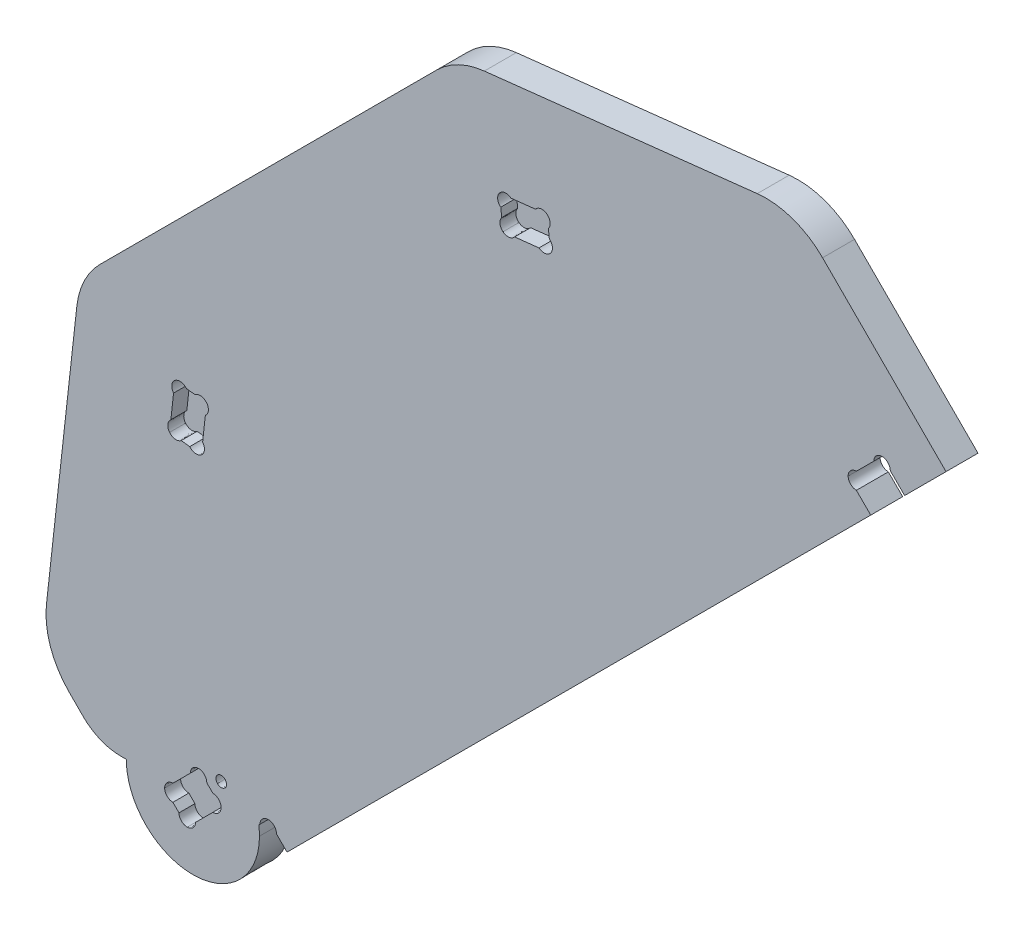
ISO-10303-21;
HEADER;
FILE_DESCRIPTION(('STEP AP214'),'2;1');
FILE_NAME('part.step','',(''),(''),'','','');
FILE_SCHEMA(('AUTOMOTIVE_DESIGN { 1 0 10303 214 1 1 1 1 }'));
ENDSEC;
DATA;
#1=APPLICATION_CONTEXT('core data for automotive mechanical design processes');
#2=APPLICATION_PROTOCOL_DEFINITION('international standard','automotive_design',2000,#1);
#3=PRODUCT_CONTEXT('',#1,'mechanical');
#4=PRODUCT('Part','Part','',(#3));
#5=PRODUCT_RELATED_PRODUCT_CATEGORY('part','',(#4));
#6=PRODUCT_DEFINITION_FORMATION('','',#4);
#7=PRODUCT_DEFINITION_CONTEXT('part definition',#1,'design');
#8=PRODUCT_DEFINITION('design','',#6,#7);
#9=PRODUCT_DEFINITION_SHAPE('','',#8);
#10=(LENGTH_UNIT() NAMED_UNIT(*) SI_UNIT(.MILLI.,.METRE.));
#11=(NAMED_UNIT(*) PLANE_ANGLE_UNIT() SI_UNIT($,.RADIAN.));
#12=(NAMED_UNIT(*) SI_UNIT($,.STERADIAN.) SOLID_ANGLE_UNIT());
#13=UNCERTAINTY_MEASURE_WITH_UNIT(LENGTH_MEASURE(1.E-05),#10,'distance_accuracy_value','');
#14=(GEOMETRIC_REPRESENTATION_CONTEXT(3) GLOBAL_UNCERTAINTY_ASSIGNED_CONTEXT((#13)) GLOBAL_UNIT_ASSIGNED_CONTEXT((#10,
#11,#12)) REPRESENTATION_CONTEXT('',''));
#15=CARTESIAN_POINT('',(0.,0.,0.));
#16=DIRECTION('',(0.,0.,1.));
#17=DIRECTION('',(1.,0.,0.));
#18=AXIS2_PLACEMENT_3D('',#15,#16,#17);
#19=CARTESIAN_POINT('',(2105.97246829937,-94.5184540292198,6.));
#20=CARTESIAN_POINT('',(2105.30401230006,-95.0532188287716,6.));
#21=CARTESIAN_POINT('',(2105.19563416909,-96.028622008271,6.));
#22=CARTESIAN_POINT('',(2105.73039896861,-96.6970780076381,6.));
#23=B_SPLINE_CURVE_WITH_KNOTS('',3,(#19,#20,#21,#22),.UNSPECIFIED.,.F.,.F.,(4,4),(11.,12.),.UNSPECIFIED.);
#24=DIRECTION('',(0.,0.,-1.));
#25=VECTOR('',#24,1.);
#26=SURFACE_OF_LINEAR_EXTRUSION('',#23,#25);
#27=DIRECTION('',(0.,0.,-1.));
#28=VECTOR('',#27,1.);
#29=CARTESIAN_POINT('',(2105.73039896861,-96.6970780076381,6.));
#30=LINE('',#29,#28);
#31=CARTESIAN_POINT('',(2105.73039896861,-96.6970780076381,6.));
#32=VERTEX_POINT('',#31);
#33=CARTESIAN_POINT('',(2105.73039896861,-96.6970780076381,3.));
#34=VERTEX_POINT('',#33);
#35=EDGE_CURVE('E963',#32,#34,#30,.T.);
#36=ORIENTED_EDGE('',*,*,#35,.T.);
#37=CARTESIAN_POINT('',(2105.97246829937,-94.5184540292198,3.));
#38=CARTESIAN_POINT('',(2105.30401230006,-95.0532188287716,3.));
#39=CARTESIAN_POINT('',(2105.19563416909,-96.028622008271,3.));
#40=CARTESIAN_POINT('',(2105.73039896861,-96.6970780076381,3.));
#41=B_SPLINE_CURVE_WITH_KNOTS('',3,(#37,#38,#39,#40),.UNSPECIFIED.,.F.,.F.,(4,4),(11.,12.),.UNSPECIFIED.);
#42=CARTESIAN_POINT('',(2105.97246829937,-94.5184540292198,3.));
#43=VERTEX_POINT('',#42);
#44=EDGE_CURVE('E55',#34,#43,#41,.F.);
#45=ORIENTED_EDGE('',*,*,#44,.T.);
#46=DIRECTION('',(0.,0.,-1.));
#47=VECTOR('',#46,1.);
#48=CARTESIAN_POINT('',(2105.97246829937,-94.5184540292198,6.));
#49=LINE('',#48,#47);
#50=CARTESIAN_POINT('',(2105.97246829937,-94.5184540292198,6.));
#51=VERTEX_POINT('',#50);
#52=EDGE_CURVE('E508',#51,#43,#49,.T.);
#53=ORIENTED_EDGE('',*,*,#52,.F.);
#54=EDGE_CURVE('E862',#51,#32,#23,.T.);
#55=ORIENTED_EDGE('',*,*,#54,.T.);
#56=EDGE_LOOP('',(#36,#45,#53,#55));
#57=FACE_BOUND('',#56,.T.);
#58=ADVANCED_FACE('F38',(#57),#26,.T.);
#59=CARTESIAN_POINT('',(2108.15109227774,-94.76052335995,6.));
#60=CARTESIAN_POINT('',(2107.61632747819,-94.092067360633,6.));
#61=CARTESIAN_POINT('',(2106.64092429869,-93.9836892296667,6.));
#62=CARTESIAN_POINT('',(2105.97246829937,-94.5184540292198,6.));
#63=B_SPLINE_CURVE_WITH_KNOTS('',3,(#59,#60,#61,#62),.UNSPECIFIED.,.F.,.F.,(4,4),(10.,11.),.UNSPECIFIED.);
#64=DIRECTION('',(0.,0.,-1.));
#65=VECTOR('',#64,1.);
#66=SURFACE_OF_LINEAR_EXTRUSION('',#63,#65);
#67=ORIENTED_EDGE('',*,*,#52,.T.);
#68=CARTESIAN_POINT('',(2108.15109227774,-94.76052335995,3.));
#69=CARTESIAN_POINT('',(2107.61632747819,-94.092067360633,3.));
#70=CARTESIAN_POINT('',(2106.64092429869,-93.9836892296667,3.));
#71=CARTESIAN_POINT('',(2105.97246829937,-94.5184540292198,3.));
#72=B_SPLINE_CURVE_WITH_KNOTS('',3,(#68,#69,#70,#71),.UNSPECIFIED.,.F.,.F.,(4,4),(10.,11.),.UNSPECIFIED.);
#73=CARTESIAN_POINT('',(2108.15109227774,-94.76052335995,3.));
#74=VERTEX_POINT('',#73);
#75=EDGE_CURVE('E1226',#43,#74,#72,.F.);
#76=ORIENTED_EDGE('',*,*,#75,.T.);
#77=DIRECTION('',(0.,0.,-1.));
#78=VECTOR('',#77,1.);
#79=CARTESIAN_POINT('',(2108.15109227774,-94.76052335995,6.));
#80=LINE('',#79,#78);
#81=CARTESIAN_POINT('',(2108.15109227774,-94.76052335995,6.));
#82=VERTEX_POINT('',#81);
#83=EDGE_CURVE('E912',#82,#74,#80,.T.);
#84=ORIENTED_EDGE('',*,*,#83,.F.);
#85=EDGE_CURVE('E868',#82,#51,#63,.T.);
#86=ORIENTED_EDGE('',*,*,#85,.T.);
#87=EDGE_LOOP('',(#67,#76,#84,#86));
#88=FACE_BOUND('',#87,.T.);
#89=ADVANCED_FACE('F846',(#88),#66,.T.);
#90=CARTESIAN_POINT('',(15.3086143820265,137.777529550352,6.));
#91=DIRECTION('',(-0.110431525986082,-0.993883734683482,0.));
#92=DIRECTION('',(0.993883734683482,-0.110431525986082,0.));
#93=AXIS2_PLACEMENT_3D('',#90,#91,#92);
#94=PLANE('',#93);
#95=ORIENTED_EDGE('',*,*,#83,.T.);
#96=DIRECTION('',(0.993883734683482,-0.110431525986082,0.));
#97=VECTOR('',#96,1.);
#98=CARTESIAN_POINT('',(15.3086143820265,137.777529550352,3.));
#99=LINE('',#98,#97);
#100=CARTESIAN_POINT('',(2109.75714672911,-94.9389738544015,3.));
#101=VERTEX_POINT('',#100);
#102=EDGE_CURVE('E913',#74,#101,#99,.T.);
#103=ORIENTED_EDGE('',*,*,#102,.T.);
#104=DIRECTION('',(0.,0.,-1.));
#105=VECTOR('',#104,1.);
#106=CARTESIAN_POINT('',(2109.75714672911,-94.9389738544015,6.));
#107=LINE('',#106,#105);
#108=CARTESIAN_POINT('',(2109.75714672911,-94.9389738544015,6.));
#109=VERTEX_POINT('',#108);
#110=EDGE_CURVE('E918',#109,#101,#107,.T.);
#111=ORIENTED_EDGE('',*,*,#110,.F.);
#112=DIRECTION('',(-0.993883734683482,0.110431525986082,0.));
#113=VECTOR('',#112,1.);
#114=CARTESIAN_POINT('',(15.3086143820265,137.777529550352,6.));
#115=LINE('',#114,#113);
#116=EDGE_CURVE('E879',#109,#82,#115,.T.);
#117=ORIENTED_EDGE('',*,*,#116,.T.);
#118=EDGE_LOOP('',(#95,#103,#111,#117));
#119=FACE_BOUND('',#118,.T.);
#120=ADVANCED_FACE('F852',(#119),#94,.T.);
#121=CARTESIAN_POINT('',(2111.93577070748,-95.181043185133,6.));
#122=CARTESIAN_POINT('',(2111.40100590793,-94.512587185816,6.));
#123=CARTESIAN_POINT('',(2110.42560272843,-94.4042090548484,6.));
#124=CARTESIAN_POINT('',(2109.75714672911,-94.9389738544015,6.));
#125=B_SPLINE_CURVE_WITH_KNOTS('',3,(#121,#122,#123,#124),.UNSPECIFIED.,.F.,.F.,(4,4),(8.,9.),.UNSPECIFIED.);
#126=DIRECTION('',(0.,0.,-1.));
#127=VECTOR('',#126,1.);
#128=SURFACE_OF_LINEAR_EXTRUSION('',#125,#127);
#129=ORIENTED_EDGE('',*,*,#110,.T.);
#130=CARTESIAN_POINT('',(2111.93577070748,-95.181043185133,3.));
#131=CARTESIAN_POINT('',(2111.40100590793,-94.512587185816,3.));
#132=CARTESIAN_POINT('',(2110.42560272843,-94.4042090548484,3.));
#133=CARTESIAN_POINT('',(2109.75714672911,-94.9389738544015,3.));
#134=B_SPLINE_CURVE_WITH_KNOTS('',3,(#130,#131,#132,#133),.UNSPECIFIED.,.F.,.F.,(4,4),(8.,9.),.UNSPECIFIED.);
#135=CARTESIAN_POINT('',(2111.93577070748,-95.181043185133,3.));
#136=VERTEX_POINT('',#135);
#137=EDGE_CURVE('E1215',#101,#136,#134,.F.);
#138=ORIENTED_EDGE('',*,*,#137,.T.);
#139=DIRECTION('',(0.,0.,-1.));
#140=VECTOR('',#139,1.);
#141=CARTESIAN_POINT('',(2111.93577070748,-95.181043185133,6.));
#142=LINE('',#141,#140);
#143=CARTESIAN_POINT('',(2111.93577070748,-95.181043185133,6.));
#144=VERTEX_POINT('',#143);
#145=EDGE_CURVE('E922',#144,#136,#142,.T.);
#146=ORIENTED_EDGE('',*,*,#145,.F.);
#147=EDGE_CURVE('E885',#144,#109,#125,.T.);
#148=ORIENTED_EDGE('',*,*,#147,.T.);
#149=EDGE_LOOP('',(#129,#138,#146,#148));
#150=FACE_BOUND('',#149,.T.);
#151=ADVANCED_FACE('F900',(#150),#128,.T.);
#152=CARTESIAN_POINT('',(2111.6937013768,-97.3596671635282,6.));
#153=CARTESIAN_POINT('',(2112.36215737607,-96.8249023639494,6.));
#154=CARTESIAN_POINT('',(2112.47053550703,-95.8494991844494,6.));
#155=CARTESIAN_POINT('',(2111.93577070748,-95.181043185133,6.));
#156=B_SPLINE_CURVE_WITH_KNOTS('',3,(#152,#153,#154,#155),.UNSPECIFIED.,.F.,.F.,(4,4),(7.,8.),.UNSPECIFIED.);
#157=DIRECTION('',(0.,0.,-1.));
#158=VECTOR('',#157,1.);
#159=SURFACE_OF_LINEAR_EXTRUSION('',#156,#158);
#160=ORIENTED_EDGE('',*,*,#145,.T.);
#161=CARTESIAN_POINT('',(2111.6937013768,-97.3596671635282,3.));
#162=CARTESIAN_POINT('',(2112.36215737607,-96.8249023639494,3.));
#163=CARTESIAN_POINT('',(2112.47053550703,-95.8494991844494,3.));
#164=CARTESIAN_POINT('',(2111.93577070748,-95.181043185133,3.));
#165=B_SPLINE_CURVE_WITH_KNOTS('',3,(#161,#162,#163,#164),.UNSPECIFIED.,.F.,.F.,(4,4),(7.,8.),.UNSPECIFIED.);
#166=CARTESIAN_POINT('',(2111.6937013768,-97.3596671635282,3.));
#167=VERTEX_POINT('',#166);
#168=EDGE_CURVE('E1210',#136,#167,#165,.F.);
#169=ORIENTED_EDGE('',*,*,#168,.T.);
#170=DIRECTION('',(0.,0.,-1.));
#171=VECTOR('',#170,1.);
#172=CARTESIAN_POINT('',(2111.6937013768,-97.3596671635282,6.));
#173=LINE('',#172,#171);
#174=CARTESIAN_POINT('',(2111.6937013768,-97.3596671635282,6.));
#175=VERTEX_POINT('',#174);
#176=EDGE_CURVE('E1485',#175,#167,#173,.T.);
#177=ORIENTED_EDGE('',*,*,#176,.F.);
#178=EDGE_CURVE('E891',#175,#144,#156,.T.);
#179=ORIENTED_EDGE('',*,*,#178,.T.);
#180=EDGE_LOOP('',(#160,#169,#177,#179));
#181=FACE_BOUND('',#180,.T.);
#182=ADVANCED_FACE('F903',(#181),#159,.T.);
#183=CARTESIAN_POINT('',(2096.62715632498,-232.958572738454,6.));
#184=DIRECTION('',(-0.993883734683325,0.110431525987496,0.));
#185=DIRECTION('',(-0.110431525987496,-0.993883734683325,0.));
#186=AXIS2_PLACEMENT_3D('',#183,#184,#185);
#187=PLANE('',#186);
#188=ORIENTED_EDGE('',*,*,#176,.T.);
#189=DIRECTION('',(-0.110431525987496,-0.993883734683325,0.));
#190=VECTOR('',#189,1.);
#191=CARTESIAN_POINT('',(2096.62715632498,-232.958572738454,3.));
#192=LINE('',#191,#190);
#193=CARTESIAN_POINT('',(2111.18395630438,-101.947372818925,3.));
#194=VERTEX_POINT('',#193);
#195=EDGE_CURVE('E1204',#167,#194,#192,.T.);
#196=ORIENTED_EDGE('',*,*,#195,.T.);
#197=DIRECTION('',(0.,0.,-1.));
#198=VECTOR('',#197,1.);
#199=CARTESIAN_POINT('',(2111.18395630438,-101.947372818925,6.));
#200=LINE('',#199,#198);
#201=CARTESIAN_POINT('',(2111.18395630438,-101.947372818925,6.));
#202=VERTEX_POINT('',#201);
#203=EDGE_CURVE('E1482',#202,#194,#200,.T.);
#204=ORIENTED_EDGE('',*,*,#203,.F.);
#205=DIRECTION('',(0.110431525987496,0.993883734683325,0.));
#206=VECTOR('',#205,1.);
#207=CARTESIAN_POINT('',(2096.62715632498,-232.958572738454,6.));
#208=LINE('',#207,#206);
#209=EDGE_CURVE('E1495',#202,#175,#208,.T.);
#210=ORIENTED_EDGE('',*,*,#209,.T.);
#211=EDGE_LOOP('',(#188,#196,#204,#210));
#212=FACE_BOUND('',#211,.T.);
#213=ADVANCED_FACE('F1498',(#212),#187,.T.);
#214=CARTESIAN_POINT('',(2110.94188697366,-104.125996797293,6.));
#215=CARTESIAN_POINT('',(2111.61034297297,-103.591231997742,6.));
#216=CARTESIAN_POINT('',(2111.71872110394,-102.615828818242,6.));
#217=CARTESIAN_POINT('',(2111.18395630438,-101.947372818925,6.));
#218=B_SPLINE_CURVE_WITH_KNOTS('',3,(#214,#215,#216,#217),.UNSPECIFIED.,.F.,.F.,(4,4),(5.,6.),.UNSPECIFIED.);
#219=DIRECTION('',(0.,0.,-1.));
#220=VECTOR('',#219,1.);
#221=SURFACE_OF_LINEAR_EXTRUSION('',#218,#220);
#222=ORIENTED_EDGE('',*,*,#203,.T.);
#223=CARTESIAN_POINT('',(2110.94188697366,-104.125996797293,3.));
#224=CARTESIAN_POINT('',(2111.61034297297,-103.591231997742,3.));
#225=CARTESIAN_POINT('',(2111.71872110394,-102.615828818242,3.));
#226=CARTESIAN_POINT('',(2111.18395630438,-101.947372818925,3.));
#227=B_SPLINE_CURVE_WITH_KNOTS('',3,(#223,#224,#225,#226),.UNSPECIFIED.,.F.,.F.,(4,4),(5.,6.),.UNSPECIFIED.);
#228=CARTESIAN_POINT('',(2110.94188697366,-104.125996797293,3.));
#229=VERTEX_POINT('',#228);
#230=EDGE_CURVE('E1196',#194,#229,#227,.F.);
#231=ORIENTED_EDGE('',*,*,#230,.T.);
#232=DIRECTION('',(0.,0.,-1.));
#233=VECTOR('',#232,1.);
#234=CARTESIAN_POINT('',(2110.94188697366,-104.125996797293,6.));
#235=LINE('',#234,#233);
#236=CARTESIAN_POINT('',(2110.94188697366,-104.125996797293,6.));
#237=VERTEX_POINT('',#236);
#238=EDGE_CURVE('E1479',#237,#229,#235,.T.);
#239=ORIENTED_EDGE('',*,*,#238,.F.);
#240=EDGE_CURVE('E1499',#237,#202,#218,.T.);
#241=ORIENTED_EDGE('',*,*,#240,.T.);
#242=EDGE_LOOP('',(#222,#231,#239,#241));
#243=FACE_BOUND('',#242,.T.);
#244=ADVANCED_FACE('F1513',(#243),#221,.T.);
#245=CARTESIAN_POINT('',(2108.76326299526,-103.883927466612,6.));
#246=CARTESIAN_POINT('',(2109.29802779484,-104.552383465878,6.));
#247=CARTESIAN_POINT('',(2110.27343097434,-104.660761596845,6.));
#248=CARTESIAN_POINT('',(2110.94188697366,-104.125996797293,6.));
#249=B_SPLINE_CURVE_WITH_KNOTS('',3,(#245,#246,#247,#248),.UNSPECIFIED.,.F.,.F.,(4,4),(4.,5.),.UNSPECIFIED.);
#250=DIRECTION('',(0.,0.,-1.));
#251=VECTOR('',#250,1.);
#252=SURFACE_OF_LINEAR_EXTRUSION('',#249,#251);
#253=ORIENTED_EDGE('',*,*,#238,.T.);
#254=CARTESIAN_POINT('',(2108.76326299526,-103.883927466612,3.));
#255=CARTESIAN_POINT('',(2109.29802779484,-104.552383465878,3.));
#256=CARTESIAN_POINT('',(2110.27343097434,-104.660761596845,3.));
#257=CARTESIAN_POINT('',(2110.94188697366,-104.125996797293,3.));
#258=B_SPLINE_CURVE_WITH_KNOTS('',3,(#254,#255,#256,#257),.UNSPECIFIED.,.F.,.F.,(4,4),(4.,5.),.UNSPECIFIED.);
#259=CARTESIAN_POINT('',(2108.76326299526,-103.883927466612,3.));
#260=VERTEX_POINT('',#259);
#261=EDGE_CURVE('E1191',#229,#260,#258,.F.);
#262=ORIENTED_EDGE('',*,*,#261,.T.);
#263=DIRECTION('',(0.,0.,-1.));
#264=VECTOR('',#263,1.);
#265=CARTESIAN_POINT('',(2108.76326299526,-103.883927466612,6.));
#266=LINE('',#265,#264);
#267=CARTESIAN_POINT('',(2108.76326299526,-103.883927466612,6.));
#268=VERTEX_POINT('',#267);
#269=EDGE_CURVE('E1476',#268,#260,#266,.T.);
#270=ORIENTED_EDGE('',*,*,#269,.F.);
#271=EDGE_CURVE('E1500',#268,#237,#249,.T.);
#272=ORIENTED_EDGE('',*,*,#271,.T.);
#273=EDGE_LOOP('',(#253,#262,#270,#272));
#274=FACE_BOUND('',#273,.T.);
#275=ADVANCED_FACE('F1516',(#274),#252,.T.);
#276=CARTESIAN_POINT('',(14.3147306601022,128.832576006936,6.));
#277=DIRECTION('',(0.11043152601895,0.99388373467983,0.));
#278=DIRECTION('',(-0.99388373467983,0.11043152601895,0.));
#279=AXIS2_PLACEMENT_3D('',#276,#277,#278);
#280=PLANE('',#279);
#281=ORIENTED_EDGE('',*,*,#269,.T.);
#282=DIRECTION('',(-0.99388373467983,0.11043152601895,0.));
#283=VECTOR('',#282,1.);
#284=CARTESIAN_POINT('',(14.3147306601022,128.832576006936,3.));
#285=LINE('',#284,#283);
#286=CARTESIAN_POINT('',(2107.15720854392,-103.70547697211,3.));
#287=VERTEX_POINT('',#286);
#288=EDGE_CURVE('E1185',#260,#287,#285,.T.);
#289=ORIENTED_EDGE('',*,*,#288,.T.);
#290=DIRECTION('',(0.,0.,-1.));
#291=VECTOR('',#290,1.);
#292=CARTESIAN_POINT('',(2107.15720854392,-103.70547697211,6.));
#293=LINE('',#292,#291);
#294=CARTESIAN_POINT('',(2107.15720854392,-103.70547697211,6.));
#295=VERTEX_POINT('',#294);
#296=EDGE_CURVE('E1470',#295,#287,#293,.T.);
#297=ORIENTED_EDGE('',*,*,#296,.F.);
#298=DIRECTION('',(0.99388373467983,-0.11043152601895,0.));
#299=VECTOR('',#298,1.);
#300=CARTESIAN_POINT('',(14.3147306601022,128.832576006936,6.));
#301=LINE('',#300,#299);
#302=EDGE_CURVE('E1814',#295,#268,#301,.T.);
#303=ORIENTED_EDGE('',*,*,#302,.T.);
#304=EDGE_LOOP('',(#281,#289,#297,#303));
#305=FACE_BOUND('',#304,.T.);
#306=ADVANCED_FACE('F1761',(#305),#280,.T.);
#307=CARTESIAN_POINT('',(2104.97858456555,-103.463407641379,6.));
#308=CARTESIAN_POINT('',(2105.5133493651,-104.131863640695,6.));
#309=CARTESIAN_POINT('',(2106.4887525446,-104.240241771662,6.));
#310=CARTESIAN_POINT('',(2107.15720854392,-103.70547697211,6.));
#311=B_SPLINE_CURVE_WITH_KNOTS('',3,(#307,#308,#309,#310),.UNSPECIFIED.,.F.,.F.,(4,4),(2.,3.),.UNSPECIFIED.);
#312=DIRECTION('',(0.,0.,-1.));
#313=VECTOR('',#312,1.);
#314=SURFACE_OF_LINEAR_EXTRUSION('',#311,#313);
#315=ORIENTED_EDGE('',*,*,#296,.T.);
#316=CARTESIAN_POINT('',(2104.97858456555,-103.463407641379,3.));
#317=CARTESIAN_POINT('',(2105.5133493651,-104.131863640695,3.));
#318=CARTESIAN_POINT('',(2106.4887525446,-104.240241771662,3.));
#319=CARTESIAN_POINT('',(2107.15720854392,-103.70547697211,3.));
#320=B_SPLINE_CURVE_WITH_KNOTS('',3,(#316,#317,#318,#319),.UNSPECIFIED.,.F.,.F.,(4,4),(2.,3.),.UNSPECIFIED.);
#321=CARTESIAN_POINT('',(2104.97858456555,-103.463407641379,3.));
#322=VERTEX_POINT('',#321);
#323=EDGE_CURVE('E1177',#287,#322,#320,.F.);
#324=ORIENTED_EDGE('',*,*,#323,.T.);
#325=DIRECTION('',(0.,0.,-1.));
#326=VECTOR('',#325,1.);
#327=CARTESIAN_POINT('',(2104.97858456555,-103.463407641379,6.));
#328=LINE('',#327,#326);
#329=CARTESIAN_POINT('',(2104.97858456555,-103.463407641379,6.));
#330=VERTEX_POINT('',#329);
#331=EDGE_CURVE('E1468',#330,#322,#328,.T.);
#332=ORIENTED_EDGE('',*,*,#331,.F.);
#333=EDGE_CURVE('E1449',#330,#295,#311,.T.);
#334=ORIENTED_EDGE('',*,*,#333,.T.);
#335=EDGE_LOOP('',(#315,#324,#332,#334));
#336=FACE_BOUND('',#335,.T.);
#337=ADVANCED_FACE('F1440',(#336),#314,.T.);
#338=CARTESIAN_POINT('',(2105.22065389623,-101.284783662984,6.));
#339=CARTESIAN_POINT('',(2104.55219789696,-101.819548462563,6.));
#340=CARTESIAN_POINT('',(2104.443819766,-102.794951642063,6.));
#341=CARTESIAN_POINT('',(2104.97858456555,-103.463407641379,6.));
#342=B_SPLINE_CURVE_WITH_KNOTS('',3,(#338,#339,#340,#341),.UNSPECIFIED.,.F.,.F.,(4,4),(1.,2.),.UNSPECIFIED.);
#343=DIRECTION('',(0.,0.,-1.));
#344=VECTOR('',#343,1.);
#345=SURFACE_OF_LINEAR_EXTRUSION('',#342,#344);
#346=ORIENTED_EDGE('',*,*,#331,.T.);
#347=CARTESIAN_POINT('',(2105.22065389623,-101.284783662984,3.));
#348=CARTESIAN_POINT('',(2104.55219789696,-101.819548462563,3.));
#349=CARTESIAN_POINT('',(2104.443819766,-102.794951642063,3.));
#350=CARTESIAN_POINT('',(2104.97858456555,-103.463407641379,3.));
#351=B_SPLINE_CURVE_WITH_KNOTS('',3,(#347,#348,#349,#350),.UNSPECIFIED.,.F.,.F.,(4,4),(1.,2.),.UNSPECIFIED.);
#352=CARTESIAN_POINT('',(2105.22065389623,-101.284783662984,3.));
#353=VERTEX_POINT('',#352);
#354=EDGE_CURVE('E1172',#322,#353,#351,.F.);
#355=ORIENTED_EDGE('',*,*,#354,.T.);
#356=DIRECTION('',(0.,0.,-1.));
#357=VECTOR('',#356,1.);
#358=CARTESIAN_POINT('',(2105.22065389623,-101.284783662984,6.));
#359=LINE('',#358,#357);
#360=CARTESIAN_POINT('',(2105.22065389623,-101.284783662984,6.));
#361=VERTEX_POINT('',#360);
#362=EDGE_CURVE('E1460',#361,#353,#359,.T.);
#363=ORIENTED_EDGE('',*,*,#362,.F.);
#364=EDGE_CURVE('E1444',#361,#330,#342,.T.);
#365=ORIENTED_EDGE('',*,*,#364,.T.);
#366=EDGE_LOOP('',(#346,#355,#363,#365));
#367=FACE_BOUND('',#366,.T.);
#368=ADVANCED_FACE('F1435',(#367),#345,.T.);
#369=CARTESIAN_POINT('',(2166.92289439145,-33.5680279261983,6.));
#370=CARTESIAN_POINT('',(2166.38812959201,-34.2364839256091,6.));
#371=CARTESIAN_POINT('',(2166.49650772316,-35.2118871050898,6.));
#372=CARTESIAN_POINT('',(2167.16496372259,-35.7466519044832,6.));
#373=B_SPLINE_CURVE_WITH_KNOTS('',3,(#369,#370,#371,#372),.UNSPECIFIED.,.F.,.F.,(4,4),(10.,11.),.UNSPECIFIED.);
#374=DIRECTION('',(0.,0.,-1.));
#375=VECTOR('',#374,1.);
#376=SURFACE_OF_LINEAR_EXTRUSION('',#373,#375);
#377=DIRECTION('',(0.,0.,-1.));
#378=VECTOR('',#377,1.);
#379=CARTESIAN_POINT('',(2167.16496372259,-35.7466519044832,6.));
#380=LINE('',#379,#378);
#381=CARTESIAN_POINT('',(2167.16496372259,-35.7466519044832,6.));
#382=VERTEX_POINT('',#381);
#383=CARTESIAN_POINT('',(2167.16496372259,-35.7466519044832,3.));
#384=VERTEX_POINT('',#383);
#385=EDGE_CURVE('E926',#382,#384,#380,.T.);
#386=ORIENTED_EDGE('',*,*,#385,.T.);
#387=CARTESIAN_POINT('',(2166.92289439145,-33.5680279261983,3.));
#388=CARTESIAN_POINT('',(2166.38812959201,-34.2364839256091,3.));
#389=CARTESIAN_POINT('',(2166.49650772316,-35.2118871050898,3.));
#390=CARTESIAN_POINT('',(2167.16496372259,-35.7466519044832,3.));
#391=B_SPLINE_CURVE_WITH_KNOTS('',3,(#387,#388,#389,#390),.UNSPECIFIED.,.F.,.F.,(4,4),(10.,11.),.UNSPECIFIED.);
#392=CARTESIAN_POINT('',(2166.92289439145,-33.5680279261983,3.));
#393=VERTEX_POINT('',#392);
#394=EDGE_CURVE('E63',#384,#393,#391,.F.);
#395=ORIENTED_EDGE('',*,*,#394,.T.);
#396=DIRECTION('',(0.,0.,-1.));
#397=VECTOR('',#396,1.);
#398=CARTESIAN_POINT('',(2166.92289439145,-33.5680279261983,6.));
#399=LINE('',#398,#397);
#400=CARTESIAN_POINT('',(2166.92289439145,-33.5680279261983,6.));
#401=VERTEX_POINT('',#400);
#402=EDGE_CURVE('E960',#401,#393,#399,.T.);
#403=ORIENTED_EDGE('',*,*,#402,.F.);
#404=EDGE_CURVE('E984',#401,#382,#373,.T.);
#405=ORIENTED_EDGE('',*,*,#404,.T.);
#406=EDGE_LOOP('',(#386,#395,#403,#405));
#407=FACE_BOUND('',#406,.T.);
#408=ADVANCED_FACE('F1439',(#407),#376,.T.);
#409=CARTESIAN_POINT('',(2169.10151836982,-33.3259585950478,6.));
#410=CARTESIAN_POINT('',(2168.43306237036,-32.7911937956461,6.));
#411=CARTESIAN_POINT('',(2167.45765919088,-32.8995719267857,6.));
#412=CARTESIAN_POINT('',(2166.92289439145,-33.5680279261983,6.));
#413=B_SPLINE_CURVE_WITH_KNOTS('',3,(#409,#410,#411,#412),.UNSPECIFIED.,.F.,.F.,(4,4),(9.,10.),.UNSPECIFIED.);
#414=DIRECTION('',(0.,0.,-1.));
#415=VECTOR('',#414,1.);
#416=SURFACE_OF_LINEAR_EXTRUSION('',#413,#415);
#417=ORIENTED_EDGE('',*,*,#402,.T.);
#418=CARTESIAN_POINT('',(2169.10151836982,-33.3259585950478,3.));
#419=CARTESIAN_POINT('',(2168.43306237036,-32.7911937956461,3.));
#420=CARTESIAN_POINT('',(2167.45765919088,-32.8995719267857,3.));
#421=CARTESIAN_POINT('',(2166.92289439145,-33.5680279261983,3.));
#422=B_SPLINE_CURVE_WITH_KNOTS('',3,(#418,#419,#420,#421),.UNSPECIFIED.,.F.,.F.,(4,4),(9.,10.),.UNSPECIFIED.);
#423=CARTESIAN_POINT('',(2169.10151836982,-33.3259585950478,3.));
#424=VERTEX_POINT('',#423);
#425=EDGE_CURVE('E1156',#393,#424,#422,.F.);
#426=ORIENTED_EDGE('',*,*,#425,.T.);
#427=DIRECTION('',(0.,0.,-1.));
#428=VECTOR('',#427,1.);
#429=CARTESIAN_POINT('',(2169.10151836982,-33.3259585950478,6.));
#430=LINE('',#429,#428);
#431=CARTESIAN_POINT('',(2169.10151836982,-33.3259585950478,6.));
#432=VERTEX_POINT('',#431);
#433=EDGE_CURVE('E957',#432,#424,#430,.T.);
#434=ORIENTED_EDGE('',*,*,#433,.F.);
#435=EDGE_CURVE('E2123',#432,#401,#413,.T.);
#436=ORIENTED_EDGE('',*,*,#435,.T.);
#437=EDGE_LOOP('',(#417,#426,#434,#436));
#438=FACE_BOUND('',#437,.T.);
#439=ADVANCED_FACE('F1732',(#438),#416,.T.);
#440=CARTESIAN_POINT('',(30.1101847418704,-270.991662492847,6.));
#441=DIRECTION('',(0.110431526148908,-0.99388373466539,0.));
#442=DIRECTION('',(0.99388373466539,0.110431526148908,0.));
#443=AXIS2_PLACEMENT_3D('',#440,#441,#442);
#444=PLANE('',#443);
#445=ORIENTED_EDGE('',*,*,#433,.T.);
#446=DIRECTION('',(0.99388373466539,0.110431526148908,0.));
#447=VECTOR('',#446,1.);
#448=CARTESIAN_POINT('',(30.1101847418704,-270.991662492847,3.));
#449=LINE('',#448,#447);
#450=CARTESIAN_POINT('',(2173.6892240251,-32.8162135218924,3.));
#451=VERTEX_POINT('',#450);
#452=EDGE_CURVE('E1150',#424,#451,#449,.T.);
#453=ORIENTED_EDGE('',*,*,#452,.T.);
#454=DIRECTION('',(0.,0.,-1.));
#455=VECTOR('',#454,1.);
#456=CARTESIAN_POINT('',(2173.6892240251,-32.8162135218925,6.));
#457=LINE('',#456,#455);
#458=CARTESIAN_POINT('',(2173.6892240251,-32.8162135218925,6.));
#459=VERTEX_POINT('',#458);
#460=EDGE_CURVE('E954',#459,#451,#457,.T.);
#461=ORIENTED_EDGE('',*,*,#460,.F.);
#462=DIRECTION('',(-0.99388373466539,-0.110431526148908,0.));
#463=VECTOR('',#462,1.);
#464=CARTESIAN_POINT('',(30.1101847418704,-270.991662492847,6.));
#465=LINE('',#464,#463);
#466=EDGE_CURVE('E2132',#459,#432,#465,.T.);
#467=ORIENTED_EDGE('',*,*,#466,.T.);
#468=EDGE_LOOP('',(#445,#453,#461,#467));
#469=FACE_BOUND('',#468,.T.);
#470=ADVANCED_FACE('F1723',(#469),#444,.T.);
#471=CARTESIAN_POINT('',(2175.86784800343,-32.5741441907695,6.));
#472=CARTESIAN_POINT('',(2175.19939200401,-32.0393793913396,6.));
#473=CARTESIAN_POINT('',(2174.22398882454,-32.1477575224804,6.));
#474=CARTESIAN_POINT('',(2173.6892240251,-32.8162135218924,6.));
#475=B_SPLINE_CURVE_WITH_KNOTS('',3,(#471,#472,#473,#474),.UNSPECIFIED.,.F.,.F.,(4,4),(7.,8.),.UNSPECIFIED.);
#476=DIRECTION('',(0.,0.,-1.));
#477=VECTOR('',#476,1.);
#478=SURFACE_OF_LINEAR_EXTRUSION('',#475,#477);
#479=ORIENTED_EDGE('',*,*,#460,.T.);
#480=CARTESIAN_POINT('',(2175.86784800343,-32.5741441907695,3.));
#481=CARTESIAN_POINT('',(2175.19939200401,-32.0393793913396,3.));
#482=CARTESIAN_POINT('',(2174.22398882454,-32.1477575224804,3.));
#483=CARTESIAN_POINT('',(2173.6892240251,-32.8162135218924,3.));
#484=B_SPLINE_CURVE_WITH_KNOTS('',3,(#480,#481,#482,#483),.UNSPECIFIED.,.F.,.F.,(4,4),(7.,8.),.UNSPECIFIED.);
#485=CARTESIAN_POINT('',(2175.86784800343,-32.5741441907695,3.));
#486=VERTEX_POINT('',#485);
#487=EDGE_CURVE('E1142',#451,#486,#484,.F.);
#488=ORIENTED_EDGE('',*,*,#487,.T.);
#489=DIRECTION('',(0.,0.,-1.));
#490=VECTOR('',#489,1.);
#491=CARTESIAN_POINT('',(2175.86784800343,-32.5741441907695,6.));
#492=LINE('',#491,#490);
#493=CARTESIAN_POINT('',(2175.86784800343,-32.5741441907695,6.));
#494=VERTEX_POINT('',#493);
#495=EDGE_CURVE('E951',#494,#486,#492,.T.);
#496=ORIENTED_EDGE('',*,*,#495,.F.);
#497=EDGE_CURVE('E2138',#494,#459,#475,.T.);
#498=ORIENTED_EDGE('',*,*,#497,.T.);
#499=EDGE_LOOP('',(#479,#488,#496,#498));
#500=FACE_BOUND('',#499,.T.);
#501=ADVANCED_FACE('F1714',(#500),#478,.T.);
#502=CARTESIAN_POINT('',(2176.10991733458,-34.7527681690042,6.));
#503=CARTESIAN_POINT('',(2176.64468213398,-34.0843121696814,6.));
#504=CARTESIAN_POINT('',(2176.53630400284,-33.1089089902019,6.));
#505=CARTESIAN_POINT('',(2175.86784800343,-32.5741441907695,6.));
#506=B_SPLINE_CURVE_WITH_KNOTS('',3,(#502,#503,#504,#505),.UNSPECIFIED.,.F.,.F.,(4,4),(6.,7.),.UNSPECIFIED.);
#507=DIRECTION('',(0.,0.,-1.));
#508=VECTOR('',#507,1.);
#509=SURFACE_OF_LINEAR_EXTRUSION('',#506,#508);
#510=ORIENTED_EDGE('',*,*,#495,.T.);
#511=CARTESIAN_POINT('',(2176.10991733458,-34.7527681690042,3.));
#512=CARTESIAN_POINT('',(2176.64468213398,-34.0843121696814,3.));
#513=CARTESIAN_POINT('',(2176.53630400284,-33.1089089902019,3.));
#514=CARTESIAN_POINT('',(2175.86784800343,-32.5741441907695,3.));
#515=B_SPLINE_CURVE_WITH_KNOTS('',3,(#511,#512,#513,#514),.UNSPECIFIED.,.F.,.F.,(4,4),(6.,7.),.UNSPECIFIED.);
#516=CARTESIAN_POINT('',(2176.10991733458,-34.7527681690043,3.));
#517=VERTEX_POINT('',#516);
#518=EDGE_CURVE('E1137',#486,#517,#515,.F.);
#519=ORIENTED_EDGE('',*,*,#518,.T.);
#520=DIRECTION('',(0.,0.,-1.));
#521=VECTOR('',#520,1.);
#522=CARTESIAN_POINT('',(2176.10991733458,-34.7527681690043,6.));
#523=LINE('',#522,#521);
#524=CARTESIAN_POINT('',(2176.10991733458,-34.7527681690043,6.));
#525=VERTEX_POINT('',#524);
#526=EDGE_CURVE('E948',#525,#517,#523,.T.);
#527=ORIENTED_EDGE('',*,*,#526,.F.);
#528=EDGE_CURVE('E2144',#525,#494,#506,.T.);
#529=ORIENTED_EDGE('',*,*,#528,.T.);
#530=EDGE_LOOP('',(#510,#519,#527,#529));
#531=FACE_BOUND('',#530,.T.);
#532=ADVANCED_FACE('F1705',(#531),#509,.T.);
#533=CARTESIAN_POINT('',(2145.75766326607,238.417518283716,6.));
#534=DIRECTION('',(-0.993883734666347,-0.110431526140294,0.));
#535=DIRECTION('',(0.110431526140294,-0.993883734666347,0.));
#536=AXIS2_PLACEMENT_3D('',#533,#534,#535);
#537=PLANE('',#536);
#538=ORIENTED_EDGE('',*,*,#526,.T.);
#539=DIRECTION('',(0.110431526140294,-0.993883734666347,0.));
#540=VECTOR('',#539,1.);
#541=CARTESIAN_POINT('',(2145.75766326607,238.417518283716,3.));
#542=LINE('',#541,#540);
#543=CARTESIAN_POINT('',(2176.28836782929,-36.3588226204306,3.));
#544=VERTEX_POINT('',#543);
#545=EDGE_CURVE('E1131',#517,#544,#542,.T.);
#546=ORIENTED_EDGE('',*,*,#545,.T.);
#547=DIRECTION('',(0.,0.,-1.));
#548=VECTOR('',#547,1.);
#549=CARTESIAN_POINT('',(2176.28836782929,-36.3588226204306,6.));
#550=LINE('',#549,#548);
#551=CARTESIAN_POINT('',(2176.28836782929,-36.3588226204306,6.));
#552=VERTEX_POINT('',#551);
#553=EDGE_CURVE('E945',#552,#544,#550,.T.);
#554=ORIENTED_EDGE('',*,*,#553,.F.);
#555=DIRECTION('',(-0.110431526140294,0.993883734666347,0.));
#556=VECTOR('',#555,1.);
#557=CARTESIAN_POINT('',(2145.75766326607,238.417518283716,6.));
#558=LINE('',#557,#556);
#559=EDGE_CURVE('E2160',#552,#525,#558,.T.);
#560=ORIENTED_EDGE('',*,*,#559,.T.);
#561=EDGE_LOOP('',(#538,#546,#554,#560));
#562=FACE_BOUND('',#561,.T.);
#563=ADVANCED_FACE('F1696',(#562),#537,.T.);
#564=CARTESIAN_POINT('',(2176.53043716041,-38.5374465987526,6.));
#565=CARTESIAN_POINT('',(2177.06520195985,-37.8689905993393,6.));
#566=CARTESIAN_POINT('',(2176.9568238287,-36.8935874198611,6.));
#567=CARTESIAN_POINT('',(2176.28836782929,-36.3588226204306,6.));
#568=B_SPLINE_CURVE_WITH_KNOTS('',3,(#564,#565,#566,#567),.UNSPECIFIED.,.F.,.F.,(4,4),(4.,5.),.UNSPECIFIED.);
#569=DIRECTION('',(0.,0.,-1.));
#570=VECTOR('',#569,1.);
#571=SURFACE_OF_LINEAR_EXTRUSION('',#568,#570);
#572=ORIENTED_EDGE('',*,*,#553,.T.);
#573=CARTESIAN_POINT('',(2176.53043716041,-38.5374465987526,3.));
#574=CARTESIAN_POINT('',(2177.06520195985,-37.8689905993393,3.));
#575=CARTESIAN_POINT('',(2176.9568238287,-36.8935874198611,3.));
#576=CARTESIAN_POINT('',(2176.28836782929,-36.3588226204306,3.));
#577=B_SPLINE_CURVE_WITH_KNOTS('',3,(#573,#574,#575,#576),.UNSPECIFIED.,.F.,.F.,(4,4),(4.,5.),.UNSPECIFIED.);
#578=CARTESIAN_POINT('',(2176.53043716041,-38.5374465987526,3.));
#579=VERTEX_POINT('',#578);
#580=EDGE_CURVE('E1123',#544,#579,#577,.F.);
#581=ORIENTED_EDGE('',*,*,#580,.T.);
#582=DIRECTION('',(0.,0.,-1.));
#583=VECTOR('',#582,1.);
#584=CARTESIAN_POINT('',(2176.53043716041,-38.5374465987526,6.));
#585=LINE('',#584,#583);
#586=CARTESIAN_POINT('',(2176.53043716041,-38.5374465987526,6.));
#587=VERTEX_POINT('',#586);
#588=EDGE_CURVE('E942',#587,#579,#585,.T.);
#589=ORIENTED_EDGE('',*,*,#588,.F.);
#590=EDGE_CURVE('E2154',#587,#552,#568,.T.);
#591=ORIENTED_EDGE('',*,*,#590,.T.);
#592=EDGE_LOOP('',(#572,#581,#589,#591));
#593=FACE_BOUND('',#592,.T.);
#594=ADVANCED_FACE('F1687',(#593),#571,.T.);
#595=CARTESIAN_POINT('',(2174.35181318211,-38.7795159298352,6.));
#596=CARTESIAN_POINT('',(2175.0202691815,-39.31428072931,6.));
#597=CARTESIAN_POINT('',(2175.99567236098,-39.2059025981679,6.));
#598=CARTESIAN_POINT('',(2176.53043716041,-38.5374465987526,6.));
#599=B_SPLINE_CURVE_WITH_KNOTS('',3,(#595,#596,#597,#598),.UNSPECIFIED.,.F.,.F.,(4,4),(3.,4.),.UNSPECIFIED.);
#600=DIRECTION('',(0.,0.,-1.));
#601=VECTOR('',#600,1.);
#602=SURFACE_OF_LINEAR_EXTRUSION('',#599,#601);
#603=ORIENTED_EDGE('',*,*,#588,.T.);
#604=CARTESIAN_POINT('',(2174.35181318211,-38.7795159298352,3.));
#605=CARTESIAN_POINT('',(2175.0202691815,-39.31428072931,3.));
#606=CARTESIAN_POINT('',(2175.99567236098,-39.2059025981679,3.));
#607=CARTESIAN_POINT('',(2176.53043716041,-38.5374465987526,3.));
#608=B_SPLINE_CURVE_WITH_KNOTS('',3,(#604,#605,#606,#607),.UNSPECIFIED.,.F.,.F.,(4,4),(3.,4.),.UNSPECIFIED.);
#609=CARTESIAN_POINT('',(2174.35181318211,-38.7795159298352,3.));
#610=VERTEX_POINT('',#609);
#611=EDGE_CURVE('E1118',#579,#610,#608,.F.);
#612=ORIENTED_EDGE('',*,*,#611,.T.);
#613=DIRECTION('',(0.,0.,-1.));
#614=VECTOR('',#613,1.);
#615=CARTESIAN_POINT('',(2174.35181318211,-38.7795159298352,6.));
#616=LINE('',#615,#614);
#617=CARTESIAN_POINT('',(2174.35181318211,-38.7795159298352,6.));
#618=VERTEX_POINT('',#617);
#619=EDGE_CURVE('E939',#618,#610,#616,.T.);
#620=ORIENTED_EDGE('',*,*,#619,.F.);
#621=EDGE_CURVE('E2159',#618,#587,#599,.T.);
#622=ORIENTED_EDGE('',*,*,#621,.T.);
#623=EDGE_LOOP('',(#603,#612,#620,#622));
#624=FACE_BOUND('',#623,.T.);
#625=ADVANCED_FACE('F1678',(#624),#602,.T.);
#626=CARTESIAN_POINT('',(30.7727739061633,-276.954964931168,6.));
#627=DIRECTION('',(-0.110431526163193,0.993883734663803,0.));
#628=DIRECTION('',(-0.993883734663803,-0.110431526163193,0.));
#629=AXIS2_PLACEMENT_3D('',#626,#627,#628);
#630=PLANE('',#629);
#631=ORIENTED_EDGE('',*,*,#619,.T.);
#632=DIRECTION('',(-0.993883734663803,-0.110431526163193,0.));
#633=VECTOR('',#632,1.);
#634=CARTESIAN_POINT('',(30.7727739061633,-276.954964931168,3.));
#635=LINE('',#634,#633);
#636=CARTESIAN_POINT('',(2169.76410752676,-39.289261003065,3.));
#637=VERTEX_POINT('',#636);
#638=EDGE_CURVE('E1112',#610,#637,#635,.T.);
#639=ORIENTED_EDGE('',*,*,#638,.T.);
#640=DIRECTION('',(0.,0.,-1.));
#641=VECTOR('',#640,1.);
#642=CARTESIAN_POINT('',(2169.76410752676,-39.289261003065,6.));
#643=LINE('',#642,#641);
#644=CARTESIAN_POINT('',(2169.76410752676,-39.289261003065,6.));
#645=VERTEX_POINT('',#644);
#646=EDGE_CURVE('E936',#645,#637,#643,.T.);
#647=ORIENTED_EDGE('',*,*,#646,.F.);
#648=DIRECTION('',(0.993883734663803,0.110431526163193,0.));
#649=VECTOR('',#648,1.);
#650=CARTESIAN_POINT('',(30.7727739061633,-276.954964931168,6.));
#651=LINE('',#650,#649);
#652=EDGE_CURVE('E2169',#645,#618,#651,.T.);
#653=ORIENTED_EDGE('',*,*,#652,.T.);
#654=EDGE_LOOP('',(#631,#639,#647,#653));
#655=FACE_BOUND('',#654,.T.);
#656=ADVANCED_FACE('F1669',(#655),#630,.T.);
#657=CARTESIAN_POINT('',(2167.58548354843,-39.5313303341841,6.));
#658=CARTESIAN_POINT('',(2168.25393954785,-40.0660951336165,6.));
#659=CARTESIAN_POINT('',(2169.22934272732,-39.9577170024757,6.));
#660=CARTESIAN_POINT('',(2169.76410752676,-39.289261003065,6.));
#661=B_SPLINE_CURVE_WITH_KNOTS('',3,(#657,#658,#659,#660),.UNSPECIFIED.,.F.,.F.,(4,4),(1.,2.),.UNSPECIFIED.);
#662=DIRECTION('',(0.,0.,-1.));
#663=VECTOR('',#662,1.);
#664=SURFACE_OF_LINEAR_EXTRUSION('',#661,#663);
#665=ORIENTED_EDGE('',*,*,#646,.T.);
#666=CARTESIAN_POINT('',(2167.58548354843,-39.5313303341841,3.));
#667=CARTESIAN_POINT('',(2168.25393954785,-40.0660951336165,3.));
#668=CARTESIAN_POINT('',(2169.22934272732,-39.9577170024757,3.));
#669=CARTESIAN_POINT('',(2169.76410752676,-39.289261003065,3.));
#670=B_SPLINE_CURVE_WITH_KNOTS('',3,(#666,#667,#668,#669),.UNSPECIFIED.,.F.,.F.,(4,4),(1.,2.),.UNSPECIFIED.);
#671=CARTESIAN_POINT('',(2167.58548354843,-39.5313303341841,3.));
#672=VERTEX_POINT('',#671);
#673=EDGE_CURVE('E1104',#637,#672,#670,.F.);
#674=ORIENTED_EDGE('',*,*,#673,.T.);
#675=DIRECTION('',(0.,0.,-1.));
#676=VECTOR('',#675,1.);
#677=CARTESIAN_POINT('',(2167.58548354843,-39.5313303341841,6.));
#678=LINE('',#677,#676);
#679=CARTESIAN_POINT('',(2167.58548354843,-39.5313303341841,6.));
#680=VERTEX_POINT('',#679);
#681=EDGE_CURVE('E933',#680,#672,#678,.T.);
#682=ORIENTED_EDGE('',*,*,#681,.F.);
#683=EDGE_CURVE('E2175',#680,#645,#661,.T.);
#684=ORIENTED_EDGE('',*,*,#683,.T.);
#685=EDGE_LOOP('',(#665,#674,#682,#684));
#686=FACE_BOUND('',#685,.T.);
#687=ADVANCED_FACE('F1661',(#686),#664,.T.);
#688=CARTESIAN_POINT('',(2167.34341421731,-37.3527063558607,6.));
#689=CARTESIAN_POINT('',(2166.80864941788,-38.0211623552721,6.));
#690=CARTESIAN_POINT('',(2166.91702754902,-38.9965655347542,6.));
#691=CARTESIAN_POINT('',(2167.58548354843,-39.5313303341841,6.));
#692=B_SPLINE_CURVE_WITH_KNOTS('',3,(#688,#689,#690,#691),.UNSPECIFIED.,.F.,.F.,(4,4),(0.,1.),.UNSPECIFIED.);
#693=DIRECTION('',(0.,0.,-1.));
#694=VECTOR('',#693,1.);
#695=SURFACE_OF_LINEAR_EXTRUSION('',#692,#694);
#696=ORIENTED_EDGE('',*,*,#681,.T.);
#697=CARTESIAN_POINT('',(2167.34341421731,-37.3527063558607,3.));
#698=CARTESIAN_POINT('',(2166.80864941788,-38.0211623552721,3.));
#699=CARTESIAN_POINT('',(2166.91702754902,-38.9965655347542,3.));
#700=CARTESIAN_POINT('',(2167.58548354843,-39.5313303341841,3.));
#701=B_SPLINE_CURVE_WITH_KNOTS('',3,(#697,#698,#699,#700),.UNSPECIFIED.,.F.,.F.,(4,4),(0.,1.),.UNSPECIFIED.);
#702=CARTESIAN_POINT('',(2167.34341421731,-37.3527063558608,3.));
#703=VERTEX_POINT('',#702);
#704=EDGE_CURVE('E1099',#672,#703,#701,.F.);
#705=ORIENTED_EDGE('',*,*,#704,.T.);
#706=DIRECTION('',(0.,0.,-1.));
#707=VECTOR('',#706,1.);
#708=CARTESIAN_POINT('',(2167.34341421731,-37.3527063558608,6.));
#709=LINE('',#708,#707);
#710=CARTESIAN_POINT('',(2167.34341421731,-37.3527063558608,6.));
#711=VERTEX_POINT('',#710);
#712=EDGE_CURVE('E929',#711,#703,#709,.T.);
#713=ORIENTED_EDGE('',*,*,#712,.F.);
#714=EDGE_CURVE('E2180',#711,#680,#692,.T.);
#715=ORIENTED_EDGE('',*,*,#714,.T.);
#716=EDGE_LOOP('',(#696,#705,#713,#715));
#717=FACE_BOUND('',#716,.T.);
#718=ADVANCED_FACE('F1006',(#717),#695,.T.);
#719=CARTESIAN_POINT('',(2113.97087343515,-156.081066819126,6.));
#720=CARTESIAN_POINT('',(2114.3613977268,-156.471591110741,6.));
#721=CARTESIAN_POINT('',(2114.99456270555,-156.471591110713,6.));
#722=CARTESIAN_POINT('',(2115.77561128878,-155.690542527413,6.));
#723=CARTESIAN_POINT('',(2115.77561128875,-155.057377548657,6.));
#724=CARTESIAN_POINT('',(2115.3850869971,-154.666853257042,6.));
#725=B_SPLINE_CURVE_WITH_KNOTS('',3,(#719,#720,#721,#722,#723,#724),.UNSPECIFIED.,.F.,.F.,(4,2,
4),(0.,1.,2.),.UNSPECIFIED.);
#726=DIRECTION('',(0.,0.,-1.));
#727=VECTOR('',#726,1.);
#728=SURFACE_OF_LINEAR_EXTRUSION('',#725,#727);
#729=DIRECTION('',(0.,0.,-1.));
#730=VECTOR('',#729,1.);
#731=CARTESIAN_POINT('',(2115.3850869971,-154.666853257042,6.));
#732=LINE('',#731,#730);
#733=CARTESIAN_POINT('',(2115.3850869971,-154.666853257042,6.));
#734=VERTEX_POINT('',#733);
#735=CARTESIAN_POINT('',(2115.3850869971,-154.666853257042,3.));
#736=VERTEX_POINT('',#735);
#737=EDGE_CURVE('E503',#734,#736,#732,.T.);
#738=ORIENTED_EDGE('',*,*,#737,.T.);
#739=CARTESIAN_POINT('',(2113.97087343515,-156.081066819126,3.));
#740=CARTESIAN_POINT('',(2114.3613977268,-156.471591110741,3.));
#741=CARTESIAN_POINT('',(2114.99456270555,-156.471591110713,3.));
#742=CARTESIAN_POINT('',(2115.77561128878,-155.690542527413,3.));
#743=CARTESIAN_POINT('',(2115.77561128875,-155.057377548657,3.));
#744=CARTESIAN_POINT('',(2115.3850869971,-154.666853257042,3.));
#745=B_SPLINE_CURVE_WITH_KNOTS('',3,(#739,#740,#741,#742,#743,#744),.UNSPECIFIED.,.F.,.F.,(4,2,
4),(0.,1.,2.),.UNSPECIFIED.);
#746=CARTESIAN_POINT('',(2113.97087343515,-156.081066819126,3.));
#747=VERTEX_POINT('',#746);
#748=EDGE_CURVE('E979',#736,#747,#745,.F.);
#749=ORIENTED_EDGE('',*,*,#748,.T.);
#750=DIRECTION('',(0.,0.,-1.));
#751=VECTOR('',#750,1.);
#752=CARTESIAN_POINT('',(2113.97087343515,-156.081066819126,6.));
#753=LINE('',#752,#751);
#754=CARTESIAN_POINT('',(2113.97087343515,-156.081066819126,6.));
#755=VERTEX_POINT('',#754);
#756=EDGE_CURVE('E930',#755,#747,#753,.T.);
#757=ORIENTED_EDGE('',*,*,#756,.F.);
#758=EDGE_CURVE('E978',#755,#734,#725,.T.);
#759=ORIENTED_EDGE('',*,*,#758,.T.);
#760=EDGE_LOOP('',(#738,#749,#757,#759));
#761=FACE_BOUND('',#760,.T.);
#762=ADVANCED_FACE('F977',(#761),#728,.T.);
#763=CARTESIAN_POINT('',(1132.90464978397,-1132.9046497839,6.));
#764=DIRECTION('',(0.707106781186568,-0.707106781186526,0.));
#765=DIRECTION('',(0.707106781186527,0.707106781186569,0.));
#766=AXIS2_PLACEMENT_3D('',#763,#764,#765);
#767=PLANE('',#766);
#768=DIRECTION('',(0.,0.,-1.));
#769=VECTOR('',#768,1.);
#770=CARTESIAN_POINT('',(2105.60304610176,-160.206253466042,6.));
#771=LINE('',#770,#769);
#772=CARTESIAN_POINT('',(2105.60304610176,-160.206253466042,6.));
#773=VERTEX_POINT('',#772);
#774=CARTESIAN_POINT('',(2105.60304610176,-160.206253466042,3.));
#775=VERTEX_POINT('',#774);
#776=EDGE_CURVE('E469',#773,#775,#771,.T.);
#777=ORIENTED_EDGE('',*,*,#776,.T.);
#778=DIRECTION('',(0.707106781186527,0.707106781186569,0.));
#779=VECTOR('',#778,1.);
#780=CARTESIAN_POINT('',(1132.90464978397,-1132.9046497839,3.));
#781=LINE('',#780,#779);
#782=CARTESIAN_POINT('',(2108.8670071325,-156.942292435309,3.));
#783=VERTEX_POINT('',#782);
#784=EDGE_CURVE('E451',#775,#783,#781,.T.);
#785=ORIENTED_EDGE('',*,*,#784,.T.);
#786=DIRECTION('',(0.,0.,-1.));
#787=VECTOR('',#786,1.);
#788=CARTESIAN_POINT('',(2108.8670071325,-156.942292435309,6.));
#789=LINE('',#788,#787);
#790=CARTESIAN_POINT('',(2108.8670071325,-156.942292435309,6.));
#791=VERTEX_POINT('',#790);
#792=EDGE_CURVE('E500',#791,#783,#789,.T.);
#793=ORIENTED_EDGE('',*,*,#792,.F.);
#794=DIRECTION('',(-0.707106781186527,-0.707106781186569,0.));
#795=VECTOR('',#794,1.);
#796=CARTESIAN_POINT('',(1132.90464978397,-1132.9046497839,6.));
#797=LINE('',#796,#795);
#798=EDGE_CURVE('E751',#791,#773,#797,.T.);
#799=ORIENTED_EDGE('',*,*,#798,.T.);
#800=EDGE_LOOP('',(#777,#785,#793,#799));
#801=FACE_BOUND('',#800,.T.);
#802=ADVANCED_FACE('F40',(#801),#767,.T.);
#803=CARTESIAN_POINT('',(2110.41700713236,-155.392292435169,6.));
#804=CARTESIAN_POINT('',(2109.56096577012,-155.392292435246,6.));
#805=CARTESIAN_POINT('',(2108.86700713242,-156.086251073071,6.));
#806=CARTESIAN_POINT('',(2108.8670071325,-156.942292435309,6.));
#807=B_SPLINE_CURVE_WITH_KNOTS('',3,(#803,#804,#805,#806),.UNSPECIFIED.,.F.,.F.,(4,4),(7.,8.),.UNSPECIFIED.);
#808=DIRECTION('',(0.,0.,-1.));
#809=VECTOR('',#808,1.);
#810=SURFACE_OF_LINEAR_EXTRUSION('',#807,#809);
#811=ORIENTED_EDGE('',*,*,#792,.T.);
#812=CARTESIAN_POINT('',(2110.41700713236,-155.392292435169,3.));
#813=CARTESIAN_POINT('',(2109.56096577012,-155.392292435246,3.));
#814=CARTESIAN_POINT('',(2108.86700713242,-156.086251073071,3.));
#815=CARTESIAN_POINT('',(2108.8670071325,-156.942292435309,3.));
#816=B_SPLINE_CURVE_WITH_KNOTS('',3,(#812,#813,#814,#815),.UNSPECIFIED.,.F.,.F.,(4,4),(7.,8.),.UNSPECIFIED.);
#817=CARTESIAN_POINT('',(2110.41700713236,-155.392292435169,3.));
#818=VERTEX_POINT('',#817);
#819=EDGE_CURVE('E1073',#783,#818,#816,.F.);
#820=ORIENTED_EDGE('',*,*,#819,.T.);
#821=DIRECTION('',(0.,0.,-1.));
#822=VECTOR('',#821,1.);
#823=CARTESIAN_POINT('',(2110.41700713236,-155.392292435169,6.));
#824=LINE('',#823,#822);
#825=CARTESIAN_POINT('',(2110.41700713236,-155.392292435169,6.));
#826=VERTEX_POINT('',#825);
#827=EDGE_CURVE('E497',#826,#818,#824,.T.);
#828=ORIENTED_EDGE('',*,*,#827,.F.);
#829=EDGE_CURVE('E754',#826,#791,#807,.T.);
#830=ORIENTED_EDGE('',*,*,#829,.T.);
#831=EDGE_LOOP('',(#811,#820,#828,#830));
#832=FACE_BOUND('',#831,.T.);
#833=ADVANCED_FACE('F776',(#832),#810,.T.);
#834=CARTESIAN_POINT('',(2111.96700713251,-156.942292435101,6.));
#835=CARTESIAN_POINT('',(2111.96700713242,-156.086251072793,6.));
#836=CARTESIAN_POINT('',(2111.2730484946,-155.392292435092,6.));
#837=CARTESIAN_POINT('',(2110.41700713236,-155.392292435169,6.));
#838=B_SPLINE_CURVE_WITH_KNOTS('',3,(#834,#835,#836,#837),.UNSPECIFIED.,.F.,.F.,(4,4),(6.,7.),.UNSPECIFIED.);
#839=DIRECTION('',(0.,0.,-1.));
#840=VECTOR('',#839,1.);
#841=SURFACE_OF_LINEAR_EXTRUSION('',#838,#840);
#842=ORIENTED_EDGE('',*,*,#827,.T.);
#843=CARTESIAN_POINT('',(2111.96700713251,-156.942292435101,3.));
#844=CARTESIAN_POINT('',(2111.96700713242,-156.086251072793,3.));
#845=CARTESIAN_POINT('',(2111.2730484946,-155.392292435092,3.));
#846=CARTESIAN_POINT('',(2110.41700713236,-155.392292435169,3.));
#847=B_SPLINE_CURVE_WITH_KNOTS('',3,(#843,#844,#845,#846),.UNSPECIFIED.,.F.,.F.,(4,4),(6.,7.),.UNSPECIFIED.);
#848=CARTESIAN_POINT('',(2111.96700713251,-156.942292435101,3.));
#849=VERTEX_POINT('',#848);
#850=EDGE_CURVE('E1068',#818,#849,#847,.F.);
#851=ORIENTED_EDGE('',*,*,#850,.T.);
#852=DIRECTION('',(0.,0.,-1.));
#853=VECTOR('',#852,1.);
#854=CARTESIAN_POINT('',(2111.96700713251,-156.942292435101,6.));
#855=LINE('',#854,#853);
#856=CARTESIAN_POINT('',(2111.96700713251,-156.942292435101,6.));
#857=VERTEX_POINT('',#856);
#858=EDGE_CURVE('E494',#857,#849,#855,.T.);
#859=ORIENTED_EDGE('',*,*,#858,.F.);
#860=EDGE_CURVE('E759',#857,#826,#838,.T.);
#861=ORIENTED_EDGE('',*,*,#860,.T.);
#862=EDGE_LOOP('',(#842,#851,#859,#861));
#863=FACE_BOUND('',#862,.T.);
#864=ADVANCED_FACE('F779',(#863),#841,.T.);
#865=CARTESIAN_POINT('',(977.512357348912,977.512357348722,6.));
#866=DIRECTION('',(-0.707106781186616,-0.707106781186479,0.));
#867=DIRECTION('',(0.707106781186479,-0.707106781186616,0.));
#868=AXIS2_PLACEMENT_3D('',#865,#866,#867);
#869=PLANE('',#868);
#870=ORIENTED_EDGE('',*,*,#858,.T.);
#871=DIRECTION('',(0.707106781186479,-0.707106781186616,0.));
#872=VECTOR('',#871,1.);
#873=CARTESIAN_POINT('',(977.512357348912,977.512357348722,3.));
#874=LINE('',#873,#872);
#875=CARTESIAN_POINT('',(2113.10964781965,-158.084933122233,3.));
#876=VERTEX_POINT('',#875);
#877=EDGE_CURVE('E1062',#849,#876,#874,.T.);
#878=ORIENTED_EDGE('',*,*,#877,.T.);
#879=DIRECTION('',(0.,0.,-1.));
#880=VECTOR('',#879,1.);
#881=CARTESIAN_POINT('',(2113.10964781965,-158.084933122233,6.));
#882=LINE('',#881,#880);
#883=CARTESIAN_POINT('',(2113.10964781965,-158.084933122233,6.));
#884=VERTEX_POINT('',#883);
#885=EDGE_CURVE('E491',#884,#876,#882,.T.);
#886=ORIENTED_EDGE('',*,*,#885,.F.);
#887=DIRECTION('',(-0.707106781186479,0.707106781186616,0.));
#888=VECTOR('',#887,1.);
#889=CARTESIAN_POINT('',(977.512357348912,977.512357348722,6.));
#890=LINE('',#889,#888);
#891=EDGE_CURVE('E802',#884,#857,#890,.T.);
#892=ORIENTED_EDGE('',*,*,#891,.T.);
#893=EDGE_LOOP('',(#870,#878,#886,#892));
#894=FACE_BOUND('',#893,.T.);
#895=ADVANCED_FACE('F783',(#894),#869,.T.);
#896=CARTESIAN_POINT('',(2114.65964781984,-159.634933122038,6.));
#897=CARTESIAN_POINT('',(2114.65964781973,-158.7788917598,6.));
#898=CARTESIAN_POINT('',(2113.96568918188,-158.084933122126,6.));
#899=CARTESIAN_POINT('',(2113.10964781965,-158.084933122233,6.));
#900=B_SPLINE_CURVE_WITH_KNOTS('',3,(#896,#897,#898,#899),.UNSPECIFIED.,.F.,.F.,(4,4),(4.,5.),.UNSPECIFIED.);
#901=DIRECTION('',(0.,0.,-1.));
#902=VECTOR('',#901,1.);
#903=SURFACE_OF_LINEAR_EXTRUSION('',#900,#902);
#904=ORIENTED_EDGE('',*,*,#885,.T.);
#905=CARTESIAN_POINT('',(2114.65964781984,-159.634933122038,3.));
#906=CARTESIAN_POINT('',(2114.65964781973,-158.7788917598,3.));
#907=CARTESIAN_POINT('',(2113.96568918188,-158.084933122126,3.));
#908=CARTESIAN_POINT('',(2113.10964781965,-158.084933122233,3.));
#909=B_SPLINE_CURVE_WITH_KNOTS('',3,(#905,#906,#907,#908),.UNSPECIFIED.,.F.,.F.,(4,4),(4.,5.),.UNSPECIFIED.);
#910=CARTESIAN_POINT('',(2114.65964781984,-159.634933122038,3.));
#911=VERTEX_POINT('',#910);
#912=EDGE_CURVE('E1054',#876,#911,#909,.F.);
#913=ORIENTED_EDGE('',*,*,#912,.T.);
#914=DIRECTION('',(0.,0.,-1.));
#915=VECTOR('',#914,1.);
#916=CARTESIAN_POINT('',(2114.65964781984,-159.634933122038,6.));
#917=LINE('',#916,#915);
#918=CARTESIAN_POINT('',(2114.65964781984,-159.634933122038,6.));
#919=VERTEX_POINT('',#918);
#920=EDGE_CURVE('E488',#919,#911,#917,.T.);
#921=ORIENTED_EDGE('',*,*,#920,.F.);
#922=EDGE_CURVE('E796',#919,#884,#900,.T.);
#923=ORIENTED_EDGE('',*,*,#922,.T.);
#924=EDGE_LOOP('',(#904,#913,#921,#923));
#925=FACE_BOUND('',#924,.T.);
#926=ADVANCED_FACE('F787',(#925),#903,.T.);
#927=CARTESIAN_POINT('',(2113.10964781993,-161.184933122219,6.));
#928=CARTESIAN_POINT('',(2113.96568918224,-161.184933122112,6.));
#929=CARTESIAN_POINT('',(2114.65964781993,-160.490974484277,6.));
#930=CARTESIAN_POINT('',(2114.65964781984,-159.634933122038,6.));
#931=B_SPLINE_CURVE_WITH_KNOTS('',3,(#927,#928,#929,#930),.UNSPECIFIED.,.F.,.F.,(4,4),(3.,4.),.UNSPECIFIED.);
#932=DIRECTION('',(0.,0.,-1.));
#933=VECTOR('',#932,1.);
#934=SURFACE_OF_LINEAR_EXTRUSION('',#931,#933);
#935=ORIENTED_EDGE('',*,*,#920,.T.);
#936=CARTESIAN_POINT('',(2113.10964781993,-161.184933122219,3.));
#937=CARTESIAN_POINT('',(2113.96568918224,-161.184933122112,3.));
#938=CARTESIAN_POINT('',(2114.65964781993,-160.490974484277,3.));
#939=CARTESIAN_POINT('',(2114.65964781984,-159.634933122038,3.));
#940=B_SPLINE_CURVE_WITH_KNOTS('',3,(#936,#937,#938,#939),.UNSPECIFIED.,.F.,.F.,(4,4),(3.,4.),.UNSPECIFIED.);
#941=CARTESIAN_POINT('',(2113.10964781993,-161.184933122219,3.));
#942=VERTEX_POINT('',#941);
#943=EDGE_CURVE('E1038',#911,#942,#940,.F.);
#944=ORIENTED_EDGE('',*,*,#943,.T.);
#945=DIRECTION('',(0.,0.,-1.));
#946=VECTOR('',#945,1.);
#947=CARTESIAN_POINT('',(2113.10964781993,-161.184933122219,6.));
#948=LINE('',#947,#946);
#949=CARTESIAN_POINT('',(2113.10964781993,-161.184933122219,6.));
#950=VERTEX_POINT('',#949);
#951=EDGE_CURVE('E485',#950,#942,#948,.T.);
#952=ORIENTED_EDGE('',*,*,#951,.F.);
#953=EDGE_CURVE('E801',#950,#919,#931,.T.);
#954=ORIENTED_EDGE('',*,*,#953,.T.);
#955=EDGE_LOOP('',(#935,#944,#952,#954));
#956=FACE_BOUND('',#955,.T.);
#957=ADVANCED_FACE('F792',(#956),#934,.T.);
#958=CARTESIAN_POINT('',(1137.14729047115,-1137.14729047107,6.));
#959=DIRECTION('',(-0.707106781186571,0.707106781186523,0.));
#960=DIRECTION('',(-0.707106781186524,-0.707106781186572,0.));
#961=AXIS2_PLACEMENT_3D('',#958,#959,#960);
#962=PLANE('',#961);
#963=ORIENTED_EDGE('',*,*,#951,.T.);
#964=DIRECTION('',(-0.707106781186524,-0.707106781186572,0.));
#965=VECTOR('',#964,1.);
#966=CARTESIAN_POINT('',(1137.14729047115,-1137.14729047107,3.));
#967=LINE('',#966,#965);
#968=CARTESIAN_POINT('',(2109.84568678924,-164.448894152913,3.));
#969=VERTEX_POINT('',#968);
#970=EDGE_CURVE('E1035',#942,#969,#967,.T.);
#971=ORIENTED_EDGE('',*,*,#970,.T.);
#972=DIRECTION('',(0.,0.,-1.));
#973=VECTOR('',#972,1.);
#974=CARTESIAN_POINT('',(2109.84568678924,-164.448894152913,6.));
#975=LINE('',#974,#973);
#976=CARTESIAN_POINT('',(2109.84568678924,-164.448894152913,6.));
#977=VERTEX_POINT('',#976);
#978=EDGE_CURVE('E482',#977,#969,#975,.T.);
#979=ORIENTED_EDGE('',*,*,#978,.F.);
#980=DIRECTION('',(0.707106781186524,0.707106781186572,0.));
#981=VECTOR('',#980,1.);
#982=CARTESIAN_POINT('',(1137.14729047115,-1137.14729047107,6.));
#983=LINE('',#982,#981);
#984=EDGE_CURVE('E811',#977,#950,#983,.T.);
#985=ORIENTED_EDGE('',*,*,#984,.T.);
#986=EDGE_LOOP('',(#963,#971,#979,#985));
#987=FACE_BOUND('',#986,.T.);
#988=ADVANCED_FACE('F836',(#987),#962,.T.);
#989=CARTESIAN_POINT('',(2108.29568678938,-165.998894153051,6.));
#990=CARTESIAN_POINT('',(2109.15172815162,-165.998894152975,6.));
#991=CARTESIAN_POINT('',(2109.84568678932,-165.30493551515,6.));
#992=CARTESIAN_POINT('',(2109.84568678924,-164.448894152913,6.));
#993=B_SPLINE_CURVE_WITH_KNOTS('',3,(#989,#990,#991,#992),.UNSPECIFIED.,.F.,.F.,(4,4),(1.,2.),.UNSPECIFIED.);
#994=DIRECTION('',(0.,0.,-1.));
#995=VECTOR('',#994,1.);
#996=SURFACE_OF_LINEAR_EXTRUSION('',#993,#995);
#997=ORIENTED_EDGE('',*,*,#978,.T.);
#998=CARTESIAN_POINT('',(2108.29568678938,-165.998894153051,3.));
#999=CARTESIAN_POINT('',(2109.15172815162,-165.998894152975,3.));
#1000=CARTESIAN_POINT('',(2109.84568678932,-165.30493551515,3.));
#1001=CARTESIAN_POINT('',(2109.84568678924,-164.448894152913,3.));
#1002=B_SPLINE_CURVE_WITH_KNOTS('',3,(#998,#999,#1000,#1001),.UNSPECIFIED.,.F.,.F.,(4,4),(1.,
2.),.UNSPECIFIED.);
#1003=CARTESIAN_POINT('',(2108.29568678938,-165.998894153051,3.));
#1004=VERTEX_POINT('',#1003);
#1005=EDGE_CURVE('E1033',#969,#1004,#1002,.F.);
#1006=ORIENTED_EDGE('',*,*,#1005,.T.);
#1007=DIRECTION('',(0.,0.,-1.));
#1008=VECTOR('',#1007,1.);
#1009=CARTESIAN_POINT('',(2108.29568678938,-165.998894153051,6.));
#1010=LINE('',#1009,#1008);
#1011=CARTESIAN_POINT('',(2108.29568678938,-165.998894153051,6.));
#1012=VERTEX_POINT('',#1011);
#1013=EDGE_CURVE('E479',#1012,#1004,#1010,.T.);
#1014=ORIENTED_EDGE('',*,*,#1013,.F.);
#1015=EDGE_CURVE('E817',#1012,#977,#993,.T.);
#1016=ORIENTED_EDGE('',*,*,#1015,.T.);
#1017=EDGE_LOOP('',(#997,#1006,#1014,#1016));
#1018=FACE_BOUND('',#1017,.T.);
#1019=ADVANCED_FACE('F832',(#1018),#996,.T.);
#1020=CARTESIAN_POINT('',(2106.74568678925,-164.44889415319,6.));
#1021=CARTESIAN_POINT('',(2106.74568678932,-165.304935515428,6.));
#1022=CARTESIAN_POINT('',(2107.43964542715,-165.998894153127,6.));
#1023=CARTESIAN_POINT('',(2108.29568678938,-165.998894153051,6.));
#1024=B_SPLINE_CURVE_WITH_KNOTS('',3,(#1020,#1021,#1022,#1023),.UNSPECIFIED.,.F.,.F.,(4,4),(0.,
1.),.UNSPECIFIED.);
#1025=DIRECTION('',(0.,0.,-1.));
#1026=VECTOR('',#1025,1.);
#1027=SURFACE_OF_LINEAR_EXTRUSION('',#1024,#1026);
#1028=ORIENTED_EDGE('',*,*,#1013,.T.);
#1029=CARTESIAN_POINT('',(2106.74568678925,-164.44889415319,3.));
#1030=CARTESIAN_POINT('',(2106.74568678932,-165.304935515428,3.));
#1031=CARTESIAN_POINT('',(2107.43964542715,-165.998894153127,3.));
#1032=CARTESIAN_POINT('',(2108.29568678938,-165.998894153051,3.));
#1033=B_SPLINE_CURVE_WITH_KNOTS('',3,(#1029,#1030,#1031,#1032),.UNSPECIFIED.,.F.,.F.,(4,4),(0.,
1.),.UNSPECIFIED.);
#1034=CARTESIAN_POINT('',(2106.74568678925,-164.44889415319,3.));
#1035=VERTEX_POINT('',#1034);
#1036=EDGE_CURVE('E1036',#1004,#1035,#1033,.F.);
#1037=ORIENTED_EDGE('',*,*,#1036,.T.);
#1038=DIRECTION('',(0.,0.,-1.));
#1039=VECTOR('',#1038,1.);
#1040=CARTESIAN_POINT('',(2106.74568678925,-164.44889415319,6.));
#1041=LINE('',#1040,#1039);
#1042=CARTESIAN_POINT('',(2106.74568678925,-164.44889415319,6.));
#1043=VERTEX_POINT('',#1042);
#1044=EDGE_CURVE('E471',#1043,#1035,#1041,.T.);
#1045=ORIENTED_EDGE('',*,*,#1044,.F.);
#1046=EDGE_CURVE('E823',#1043,#1012,#1024,.T.);
#1047=ORIENTED_EDGE('',*,*,#1046,.T.);
#1048=EDGE_LOOP('',(#1028,#1037,#1045,#1047));
#1049=FACE_BOUND('',#1048,.T.);
#1050=ADVANCED_FACE('F835',(#1049),#1027,.T.);
#1051=CARTESIAN_POINT('',(971.148396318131,971.148396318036,6.));
#1052=DIRECTION('',(0.707106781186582,0.707106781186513,0.));
#1053=DIRECTION('',(-0.707106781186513,0.707106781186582,0.));
#1054=AXIS2_PLACEMENT_3D('',#1051,#1052,#1053);
#1055=PLANE('',#1054);
#1056=ORIENTED_EDGE('',*,*,#1044,.T.);
#1057=DIRECTION('',(-0.707106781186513,0.707106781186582,0.));
#1058=VECTOR('',#1057,1.);
#1059=CARTESIAN_POINT('',(971.148396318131,971.148396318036,3.));
#1060=LINE('',#1059,#1058);
#1061=CARTESIAN_POINT('',(2105.60304610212,-163.306253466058,3.));
#1062=VERTEX_POINT('',#1061);
#1063=EDGE_CURVE('E463',#1035,#1062,#1060,.T.);
#1064=ORIENTED_EDGE('',*,*,#1063,.T.);
#1065=DIRECTION('',(0.,0.,-1.));
#1066=VECTOR('',#1065,1.);
#1067=CARTESIAN_POINT('',(2105.60304610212,-163.306253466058,6.));
#1068=LINE('',#1067,#1066);
#1069=CARTESIAN_POINT('',(2105.60304610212,-163.306253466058,6.));
#1070=VERTEX_POINT('',#1069);
#1071=EDGE_CURVE('E462',#1070,#1062,#1068,.T.);
#1072=ORIENTED_EDGE('',*,*,#1071,.F.);
#1073=DIRECTION('',(0.707106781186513,-0.707106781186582,0.));
#1074=VECTOR('',#1073,1.);
#1075=CARTESIAN_POINT('',(971.148396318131,971.148396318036,6.));
#1076=LINE('',#1075,#1074);
#1077=EDGE_CURVE('E1017',#1070,#1043,#1076,.T.);
#1078=ORIENTED_EDGE('',*,*,#1077,.T.);
#1079=EDGE_LOOP('',(#1056,#1064,#1072,#1078));
#1080=FACE_BOUND('',#1079,.T.);
#1081=ADVANCED_FACE('F1013',(#1080),#1055,.T.);
#1082=CARTESIAN_POINT('',(2104.0530461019,-161.756253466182,6.));
#1083=CARTESIAN_POINT('',(2104.05304610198,-162.612294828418,6.));
#1084=CARTESIAN_POINT('',(2104.74700473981,-163.30625346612,6.));
#1085=CARTESIAN_POINT('',(2105.60304610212,-163.306253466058,6.));
#1086=B_SPLINE_CURVE_WITH_KNOTS('',3,(#1082,#1083,#1084,#1085),.UNSPECIFIED.,.F.,.F.,(4,4),(10.,
11.),.UNSPECIFIED.);
#1087=DIRECTION('',(0.,0.,-1.));
#1088=VECTOR('',#1087,1.);
#1089=SURFACE_OF_LINEAR_EXTRUSION('',#1086,#1088);
#1090=ORIENTED_EDGE('',*,*,#1071,.T.);
#1091=CARTESIAN_POINT('',(2104.0530461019,-161.756253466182,3.));
#1092=CARTESIAN_POINT('',(2104.05304610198,-162.612294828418,3.));
#1093=CARTESIAN_POINT('',(2104.74700473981,-163.30625346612,3.));
#1094=CARTESIAN_POINT('',(2105.60304610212,-163.306253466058,3.));
#1095=B_SPLINE_CURVE_WITH_KNOTS('',3,(#1091,#1092,#1093,#1094),.UNSPECIFIED.,.F.,.F.,(4,4),(10.,
11.),.UNSPECIFIED.);
#1096=CARTESIAN_POINT('',(2104.0530461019,-161.756253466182,3.));
#1097=VERTEX_POINT('',#1096);
#1098=EDGE_CURVE('E448',#1062,#1097,#1095,.F.);
#1099=ORIENTED_EDGE('',*,*,#1098,.T.);
#1100=DIRECTION('',(0.,0.,-1.));
#1101=VECTOR('',#1100,1.);
#1102=CARTESIAN_POINT('',(2104.0530461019,-161.756253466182,6.));
#1103=LINE('',#1102,#1101);
#1104=CARTESIAN_POINT('',(2104.0530461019,-161.756253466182,6.));
#1105=VERTEX_POINT('',#1104);
#1106=EDGE_CURVE('E460',#1105,#1097,#1103,.T.);
#1107=ORIENTED_EDGE('',*,*,#1106,.F.);
#1108=EDGE_CURVE('E986',#1105,#1070,#1086,.T.);
#1109=ORIENTED_EDGE('',*,*,#1108,.T.);
#1110=EDGE_LOOP('',(#1090,#1099,#1107,#1109));
#1111=FACE_BOUND('',#1110,.T.);
#1112=ADVANCED_FACE('F458',(#1111),#1089,.T.);
#1113=CARTESIAN_POINT('',(2090.66385391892,-232.295983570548,6.));
#1114=DIRECTION('',(0.993883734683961,-0.110431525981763,0.));
#1115=DIRECTION('',(0.110431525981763,0.993883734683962,0.));
#1116=AXIS2_PLACEMENT_3D('',#1113,#1114,#1115);
#1117=PLANE('',#1116);
#1118=ORIENTED_EDGE('',*,*,#362,.T.);
#1119=DIRECTION('',(0.110431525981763,0.993883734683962,0.));
#1120=VECTOR('',#1119,1.);
#1121=CARTESIAN_POINT('',(2090.66385391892,-232.295983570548,3.));
#1122=LINE('',#1121,#1120);
#1123=EDGE_CURVE('E1167',#353,#34,#1122,.T.);
#1124=ORIENTED_EDGE('',*,*,#1123,.T.);
#1125=ORIENTED_EDGE('',*,*,#35,.F.);
#1126=DIRECTION('',(-0.110431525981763,-0.993883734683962,0.));
#1127=VECTOR('',#1126,1.);
#1128=CARTESIAN_POINT('',(2090.66385391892,-232.295983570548,6.));
#1129=LINE('',#1128,#1127);
#1130=EDGE_CURVE('E1406',#32,#361,#1129,.T.);
#1131=ORIENTED_EDGE('',*,*,#1130,.T.);
#1132=EDGE_LOOP('',(#1118,#1124,#1125,#1131));
#1133=FACE_BOUND('',#1132,.T.);
#1134=ADVANCED_FACE('F1012',(#1133),#1117,.T.);
#1135=CARTESIAN_POINT('',(2136.81270964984,237.423634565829,6.));
#1136=DIRECTION('',(0.993883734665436,0.110431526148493,0.));
#1137=DIRECTION('',(-0.110431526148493,0.993883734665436,0.));
#1138=AXIS2_PLACEMENT_3D('',#1135,#1136,#1137);
#1139=PLANE('',#1138);
#1140=ORIENTED_EDGE('',*,*,#712,.T.);
#1141=DIRECTION('',(-0.110431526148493,0.993883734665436,0.));
#1142=VECTOR('',#1141,1.);
#1143=CARTESIAN_POINT('',(2136.81270964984,237.423634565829,3.));
#1144=LINE('',#1143,#1142);
#1145=EDGE_CURVE('E1094',#703,#384,#1144,.T.);
#1146=ORIENTED_EDGE('',*,*,#1145,.T.);
#1147=ORIENTED_EDGE('',*,*,#385,.F.);
#1148=DIRECTION('',(0.110431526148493,-0.993883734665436,0.));
#1149=VECTOR('',#1148,1.);
#1150=CARTESIAN_POINT('',(2136.81270964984,237.423634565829,6.));
#1151=LINE('',#1150,#1149);
#1152=EDGE_CURVE('E869',#382,#711,#1151,.T.);
#1153=ORIENTED_EDGE('',*,*,#1152,.T.);
#1154=EDGE_LOOP('',(#1140,#1146,#1147,#1153));
#1155=FACE_BOUND('',#1154,.T.);
#1156=ADVANCED_FACE('F860',(#1155),#1139,.T.);
#1157=CARTESIAN_POINT('',(2115.3850869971,-154.666853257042,6.));
#1158=CARTESIAN_POINT('',(2114.99456270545,-154.276328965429,6.));
#1159=CARTESIAN_POINT('',(2114.3613977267,-154.276328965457,6.));
#1160=CARTESIAN_POINT('',(2113.58034914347,-155.057377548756,6.));
#1161=CARTESIAN_POINT('',(2113.5803491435,-155.690542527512,6.));
#1162=CARTESIAN_POINT('',(2113.97087343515,-156.081066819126,6.));
#1163=B_SPLINE_CURVE_WITH_KNOTS('',3,(#1157,#1158,#1159,#1160,#1161,#1162),.UNSPECIFIED.,.F.,
.F.,(4,2,4),(2.,3.,4.),.UNSPECIFIED.);
#1164=DIRECTION('',(0.,0.,-1.));
#1165=VECTOR('',#1164,1.);
#1166=SURFACE_OF_LINEAR_EXTRUSION('',#1163,#1165);
#1167=ORIENTED_EDGE('',*,*,#756,.T.);
#1168=CARTESIAN_POINT('',(2115.3850869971,-154.666853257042,3.));
#1169=CARTESIAN_POINT('',(2114.99456270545,-154.276328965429,3.));
#1170=CARTESIAN_POINT('',(2114.3613977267,-154.276328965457,3.));
#1171=CARTESIAN_POINT('',(2113.58034914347,-155.057377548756,3.));
#1172=CARTESIAN_POINT('',(2113.5803491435,-155.690542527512,3.));
#1173=CARTESIAN_POINT('',(2113.97087343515,-156.081066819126,3.));
#1174=B_SPLINE_CURVE_WITH_KNOTS('',3,(#1168,#1169,#1170,#1171,#1172,#1173),.UNSPECIFIED.,.F.,
.F.,(4,2,4),(2.,3.,4.),.UNSPECIFIED.);
#1175=EDGE_CURVE('E970',#747,#736,#1174,.F.);
#1176=ORIENTED_EDGE('',*,*,#1175,.T.);
#1177=ORIENTED_EDGE('',*,*,#737,.F.);
#1178=EDGE_CURVE('E972',#734,#755,#1163,.T.);
#1179=ORIENTED_EDGE('',*,*,#1178,.T.);
#1180=EDGE_LOOP('',(#1167,#1176,#1177,#1179));
#1181=FACE_BOUND('',#1180,.T.);
#1182=ADVANCED_FACE('F969',(#1181),#1166,.T.);
#1183=CARTESIAN_POINT('',(2105.60304610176,-160.206253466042,6.));
#1184=CARTESIAN_POINT('',(2104.74700473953,-160.20625346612,6.));
#1185=CARTESIAN_POINT('',(2104.05304610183,-160.900212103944,6.));
#1186=CARTESIAN_POINT('',(2104.0530461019,-161.756253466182,6.));
#1187=B_SPLINE_CURVE_WITH_KNOTS('',3,(#1183,#1184,#1185,#1186),.UNSPECIFIED.,.F.,.F.,(4,4),(9.,
10.),.UNSPECIFIED.);
#1188=DIRECTION('',(0.,0.,-1.));
#1189=VECTOR('',#1188,1.);
#1190=SURFACE_OF_LINEAR_EXTRUSION('',#1187,#1189);
#1191=ORIENTED_EDGE('',*,*,#1106,.T.);
#1192=CARTESIAN_POINT('',(2105.60304610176,-160.206253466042,3.));
#1193=CARTESIAN_POINT('',(2104.74700473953,-160.20625346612,3.));
#1194=CARTESIAN_POINT('',(2104.05304610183,-160.900212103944,3.));
#1195=CARTESIAN_POINT('',(2104.0530461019,-161.756253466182,3.));
#1196=B_SPLINE_CURVE_WITH_KNOTS('',3,(#1192,#1193,#1194,#1195),.UNSPECIFIED.,.F.,.F.,(4,4),(9.,
10.),.UNSPECIFIED.);
#1197=EDGE_CURVE('E445',#1097,#775,#1196,.F.);
#1198=ORIENTED_EDGE('',*,*,#1197,.T.);
#1199=ORIENTED_EDGE('',*,*,#776,.F.);
#1200=EDGE_CURVE('E468',#773,#1105,#1187,.T.);
#1201=ORIENTED_EDGE('',*,*,#1200,.T.);
#1202=EDGE_LOOP('',(#1191,#1198,#1199,#1201));
#1203=FACE_BOUND('',#1202,.T.);
#1204=ADVANCED_FACE('F466',(#1203),#1190,.T.);
#1205=CARTESIAN_POINT('',(2109.35634696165,-173.19559329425,6.));
#1206=CARTESIAN_POINT('',(2102.45278758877,-173.195593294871,6.));
#1207=CARTESIAN_POINT('',(2096.85634696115,-167.599152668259,6.));
#1208=CARTESIAN_POINT('',(2096.85634696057,-160.695593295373,6.));
#1209=B_SPLINE_CURVE_WITH_KNOTS('',3,(#1205,#1206,#1207,#1208),.UNSPECIFIED.,.F.,.F.,(4,4),(26.,
27.),.UNSPECIFIED.);
#1210=DIRECTION('',(0.,0.,-1.));
#1211=VECTOR('',#1210,1.);
#1212=SURFACE_OF_LINEAR_EXTRUSION('',#1209,#1211);
#1213=CARTESIAN_POINT('',(2109.35634696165,-173.19559329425,0.));
#1214=CARTESIAN_POINT('',(2102.45278758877,-173.195593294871,0.));
#1215=CARTESIAN_POINT('',(2096.85634696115,-167.599152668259,0.));
#1216=CARTESIAN_POINT('',(2096.85634696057,-160.695593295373,0.));
#1217=B_SPLINE_CURVE_WITH_KNOTS('',3,(#1213,#1214,#1215,#1216),.UNSPECIFIED.,.F.,.F.,(4,4),(26.,
27.),.UNSPECIFIED.);
#1218=CARTESIAN_POINT('',(2109.35634696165,-173.19559329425,0.));
#1219=VERTEX_POINT('',#1218);
#1220=CARTESIAN_POINT('',(2096.85634696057,-160.695593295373,0.));
#1221=VERTEX_POINT('',#1220);
#1222=EDGE_CURVE('E615',#1219,#1221,#1217,.T.);
#1223=ORIENTED_EDGE('',*,*,#1222,.F.);
#1224=DIRECTION('',(0.,0.,-1.));
#1225=VECTOR('',#1224,1.);
#1226=CARTESIAN_POINT('',(2109.35634696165,-173.19559329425,6.));
#1227=LINE('',#1226,#1225);
#1228=CARTESIAN_POINT('',(2109.35634696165,-173.19559329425,6.));
#1229=VERTEX_POINT('',#1228);
#1230=EDGE_CURVE('E11',#1229,#1219,#1227,.T.);
#1231=ORIENTED_EDGE('',*,*,#1230,.F.);
#1232=CARTESIAN_POINT('',(2096.85634696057,-160.695593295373,6.));
#1233=VERTEX_POINT('',#1232);
#1234=EDGE_CURVE('E1403',#1229,#1233,#1209,.T.);
#1235=ORIENTED_EDGE('',*,*,#1234,.T.);
#1236=DIRECTION('',(0.,0.,-1.));
#1237=VECTOR('',#1236,1.);
#1238=CARTESIAN_POINT('',(2096.85634696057,-160.695593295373,6.));
#1239=LINE('',#1238,#1237);
#1240=EDGE_CURVE('E504',#1233,#1221,#1239,.T.);
#1241=ORIENTED_EDGE('',*,*,#1240,.T.);
#1242=EDGE_LOOP('',(#1223,#1231,#1235,#1241));
#1243=FACE_BOUND('',#1242,.T.);
#1244=ADVANCED_FACE('F1010',(#1243),#1212,.T.);
#1245=CARTESIAN_POINT('',(2121.85634696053,-160.695593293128,6.));
#1246=CARTESIAN_POINT('',(2121.85634696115,-167.599152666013,6.));
#1247=CARTESIAN_POINT('',(2116.25990633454,-173.195593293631,6.));
#1248=CARTESIAN_POINT('',(2109.35634696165,-173.19559329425,6.));
#1249=B_SPLINE_CURVE_WITH_KNOTS('',3,(#1245,#1246,#1247,#1248),.UNSPECIFIED.,.F.,.F.,(4,4),(25.,
26.),.UNSPECIFIED.);
#1250=DIRECTION('',(0.,0.,-1.));
#1251=VECTOR('',#1250,1.);
#1252=SURFACE_OF_LINEAR_EXTRUSION('',#1249,#1251);
#1253=CARTESIAN_POINT('',(2121.85634696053,-160.695593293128,0.));
#1254=CARTESIAN_POINT('',(2121.85634696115,-167.599152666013,0.));
#1255=CARTESIAN_POINT('',(2116.25990633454,-173.195593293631,0.));
#1256=CARTESIAN_POINT('',(2109.35634696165,-173.19559329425,0.));
#1257=B_SPLINE_CURVE_WITH_KNOTS('',3,(#1253,#1254,#1255,#1256),.UNSPECIFIED.,.F.,.F.,(4,4),(25.,
26.),.UNSPECIFIED.);
#1258=CARTESIAN_POINT('',(2121.85634696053,-160.695593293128,0.));
#1259=VERTEX_POINT('',#1258);
#1260=EDGE_CURVE('E610',#1259,#1219,#1257,.T.);
#1261=ORIENTED_EDGE('',*,*,#1260,.F.);
#1262=DIRECTION('',(0.,0.,-1.));
#1263=VECTOR('',#1262,1.);
#1264=CARTESIAN_POINT('',(2121.85634696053,-160.695593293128,6.));
#1265=LINE('',#1264,#1263);
#1266=CARTESIAN_POINT('',(2121.85634696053,-160.695593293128,6.));
#1267=VERTEX_POINT('',#1266);
#1268=EDGE_CURVE('E42',#1267,#1259,#1265,.T.);
#1269=ORIENTED_EDGE('',*,*,#1268,.F.);
#1270=EDGE_CURVE('E1404',#1267,#1229,#1249,.T.);
#1271=ORIENTED_EDGE('',*,*,#1270,.T.);
#1272=ORIENTED_EDGE('',*,*,#1230,.T.);
#1273=EDGE_LOOP('',(#1261,#1269,#1271,#1272));
#1274=FACE_BOUND('',#1273,.T.);
#1275=ADVANCED_FACE('F611',(#1274),#1252,.T.);
#1276=CARTESIAN_POINT('',(2121.73071563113,-158.927826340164,6.));
#1277=CARTESIAN_POINT('',(2121.81436436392,-159.513367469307,6.));
#1278=CARTESIAN_POINT('',(2121.85634696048,-160.104107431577,6.));
#1279=CARTESIAN_POINT('',(2121.85634696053,-160.695593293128,6.));
#1280=B_SPLINE_CURVE_WITH_KNOTS('',3,(#1276,#1277,#1278,#1279),.UNSPECIFIED.,.F.,.F.,(4,4),(24.,
25.),.UNSPECIFIED.);
#1281=DIRECTION('',(0.,0.,-1.));
#1282=VECTOR('',#1281,1.);
#1283=SURFACE_OF_LINEAR_EXTRUSION('',#1280,#1282);
#1284=CARTESIAN_POINT('',(2121.73071563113,-158.927826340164,0.));
#1285=CARTESIAN_POINT('',(2121.81436436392,-159.513367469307,0.));
#1286=CARTESIAN_POINT('',(2121.85634696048,-160.104107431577,0.));
#1287=CARTESIAN_POINT('',(2121.85634696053,-160.695593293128,0.));
#1288=B_SPLINE_CURVE_WITH_KNOTS('',3,(#1284,#1285,#1286,#1287),.UNSPECIFIED.,.F.,.F.,(4,4),(24.,
25.),.UNSPECIFIED.);
#1289=CARTESIAN_POINT('',(2121.73071563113,-158.927826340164,0.));
#1290=VERTEX_POINT('',#1289);
#1291=EDGE_CURVE('E602',#1290,#1259,#1288,.T.);
#1292=ORIENTED_EDGE('',*,*,#1291,.F.);
#1293=DIRECTION('',(0.,0.,-1.));
#1294=VECTOR('',#1293,1.);
#1295=CARTESIAN_POINT('',(2121.73071563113,-158.927826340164,6.));
#1296=LINE('',#1295,#1294);
#1297=CARTESIAN_POINT('',(2121.73071563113,-158.927826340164,6.));
#1298=VERTEX_POINT('',#1297);
#1299=EDGE_CURVE('E589',#1298,#1290,#1296,.T.);
#1300=ORIENTED_EDGE('',*,*,#1299,.F.);
#1301=EDGE_CURVE('E605',#1298,#1267,#1280,.T.);
#1302=ORIENTED_EDGE('',*,*,#1301,.T.);
#1303=ORIENTED_EDGE('',*,*,#1268,.T.);
#1304=EDGE_LOOP('',(#1292,#1300,#1302,#1303));
#1305=FACE_BOUND('',#1304,.T.);
#1306=ADVANCED_FACE('F600',(#1305),#1283,.T.);
#1307=CARTESIAN_POINT('',(1140.32927098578,-1140.32927098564,6.));
#1308=DIRECTION('',(0.707106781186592,-0.707106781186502,0.));
#1309=DIRECTION('',(0.707106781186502,0.707106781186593,0.));
#1310=AXIS2_PLACEMENT_3D('',#1307,#1308,#1309);
#1311=PLANE('',#1310);
#1312=DIRECTION('',(-0.707106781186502,-0.707106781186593,0.));
#1313=VECTOR('',#1312,1.);
#1314=CARTESIAN_POINT('',(1140.32927098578,-1140.32927098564,0.));
#1315=LINE('',#1314,#1313);
#1316=CARTESIAN_POINT('',(2121.94848258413,-158.710059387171,0.));
#1317=VERTEX_POINT('',#1316);
#1318=EDGE_CURVE('E619',#1317,#1290,#1315,.T.);
#1319=ORIENTED_EDGE('',*,*,#1318,.F.);
#1320=DIRECTION('',(0.,0.,-1.));
#1321=VECTOR('',#1320,1.);
#1322=CARTESIAN_POINT('',(2121.94848258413,-158.710059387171,6.));
#1323=LINE('',#1322,#1321);
#1324=CARTESIAN_POINT('',(2121.94848258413,-158.710059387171,6.));
#1325=VERTEX_POINT('',#1324);
#1326=EDGE_CURVE('E586',#1325,#1317,#1323,.T.);
#1327=ORIENTED_EDGE('',*,*,#1326,.F.);
#1328=DIRECTION('',(-0.707106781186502,-0.707106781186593,0.));
#1329=VECTOR('',#1328,1.);
#1330=CARTESIAN_POINT('',(1140.32927098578,-1140.32927098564,6.));
#1331=LINE('',#1330,#1329);
#1332=EDGE_CURVE('E1409',#1325,#1298,#1331,.T.);
#1333=ORIENTED_EDGE('',*,*,#1332,.T.);
#1334=ORIENTED_EDGE('',*,*,#1299,.T.);
#1335=EDGE_LOOP('',(#1319,#1327,#1333,#1334));
#1336=FACE_BOUND('',#1335,.T.);
#1337=ADVANCED_FACE('F2013',(#1336),#1311,.T.);
#1338=CARTESIAN_POINT('',(2123.49848258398,-157.160059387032,6.));
#1339=CARTESIAN_POINT('',(2122.64244122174,-157.160059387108,6.));
#1340=CARTESIAN_POINT('',(2121.94848258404,-157.854018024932,6.));
#1341=CARTESIAN_POINT('',(2121.94848258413,-158.710059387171,6.));
#1342=B_SPLINE_CURVE_WITH_KNOTS('',3,(#1338,#1339,#1340,#1341),.UNSPECIFIED.,.F.,.F.,(4,4),(22.,
23.),.UNSPECIFIED.);
#1343=DIRECTION('',(0.,0.,-1.));
#1344=VECTOR('',#1343,1.);
#1345=SURFACE_OF_LINEAR_EXTRUSION('',#1342,#1344);
#1346=CARTESIAN_POINT('',(2123.49848258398,-157.160059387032,0.));
#1347=CARTESIAN_POINT('',(2122.64244122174,-157.160059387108,0.));
#1348=CARTESIAN_POINT('',(2121.94848258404,-157.854018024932,0.));
#1349=CARTESIAN_POINT('',(2121.94848258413,-158.710059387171,0.));
#1350=B_SPLINE_CURVE_WITH_KNOTS('',3,(#1346,#1347,#1348,#1349),.UNSPECIFIED.,.F.,.F.,(4,4),(22.,
23.),.UNSPECIFIED.);
#1351=CARTESIAN_POINT('',(2123.49848258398,-157.160059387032,0.));
#1352=VERTEX_POINT('',#1351);
#1353=EDGE_CURVE('E621',#1352,#1317,#1350,.T.);
#1354=ORIENTED_EDGE('',*,*,#1353,.F.);
#1355=DIRECTION('',(0.,0.,-1.));
#1356=VECTOR('',#1355,1.);
#1357=CARTESIAN_POINT('',(2123.49848258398,-157.160059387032,6.));
#1358=LINE('',#1357,#1356);
#1359=CARTESIAN_POINT('',(2123.49848258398,-157.160059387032,6.));
#1360=VERTEX_POINT('',#1359);
#1361=EDGE_CURVE('E584',#1360,#1352,#1358,.T.);
#1362=ORIENTED_EDGE('',*,*,#1361,.F.);
#1363=EDGE_CURVE('E2052',#1360,#1325,#1342,.T.);
#1364=ORIENTED_EDGE('',*,*,#1363,.T.);
#1365=ORIENTED_EDGE('',*,*,#1326,.T.);
#1366=EDGE_LOOP('',(#1354,#1362,#1364,#1365));
#1367=FACE_BOUND('',#1366,.T.);
#1368=ADVANCED_FACE('F2003',(#1367),#1345,.T.);
#1369=CARTESIAN_POINT('',(2125.04848258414,-158.710059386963,6.));
#1370=CARTESIAN_POINT('',(2125.04848258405,-157.854018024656,6.));
#1371=CARTESIAN_POINT('',(2124.35452394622,-157.160059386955,6.));
#1372=CARTESIAN_POINT('',(2123.49848258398,-157.160059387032,6.));
#1373=B_SPLINE_CURVE_WITH_KNOTS('',3,(#1369,#1370,#1371,#1372),.UNSPECIFIED.,.F.,.F.,(4,4),(21.,
22.),.UNSPECIFIED.);
#1374=DIRECTION('',(0.,0.,-1.));
#1375=VECTOR('',#1374,1.);
#1376=SURFACE_OF_LINEAR_EXTRUSION('',#1373,#1375);
#1377=CARTESIAN_POINT('',(2125.04848258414,-158.710059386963,0.));
#1378=CARTESIAN_POINT('',(2125.04848258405,-157.854018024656,0.));
#1379=CARTESIAN_POINT('',(2124.35452394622,-157.160059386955,0.));
#1380=CARTESIAN_POINT('',(2123.49848258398,-157.160059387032,0.));
#1381=B_SPLINE_CURVE_WITH_KNOTS('',3,(#1377,#1378,#1379,#1380),.UNSPECIFIED.,.F.,.F.,(4,4),(21.,
22.),.UNSPECIFIED.);
#1382=CARTESIAN_POINT('',(2125.04848258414,-158.710059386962,0.));
#1383=VERTEX_POINT('',#1382);
#1384=EDGE_CURVE('E635',#1383,#1352,#1381,.T.);
#1385=ORIENTED_EDGE('',*,*,#1384,.F.);
#1386=DIRECTION('',(0.,0.,-1.));
#1387=VECTOR('',#1386,1.);
#1388=CARTESIAN_POINT('',(2125.04848258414,-158.710059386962,6.));
#1389=LINE('',#1388,#1387);
#1390=CARTESIAN_POINT('',(2125.04848258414,-158.710059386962,6.));
#1391=VERTEX_POINT('',#1390);
#1392=EDGE_CURVE('E576',#1391,#1383,#1389,.T.);
#1393=ORIENTED_EDGE('',*,*,#1392,.F.);
#1394=EDGE_CURVE('E2056',#1391,#1360,#1373,.T.);
#1395=ORIENTED_EDGE('',*,*,#1394,.T.);
#1396=ORIENTED_EDGE('',*,*,#1361,.T.);
#1397=EDGE_LOOP('',(#1385,#1393,#1395,#1396));
#1398=FACE_BOUND('',#1397,.T.);
#1399=ADVANCED_FACE('F1993',(#1398),#1376,.T.);
#1400=CARTESIAN_POINT('',(983.169211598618,983.169211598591,6.));
#1401=DIRECTION('',(-0.707106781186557,-0.707106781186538,0.));
#1402=DIRECTION('',(0.707106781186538,-0.707106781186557,0.));
#1403=AXIS2_PLACEMENT_3D('',#1400,#1401,#1402);
#1404=PLANE('',#1403);
#1405=DIRECTION('',(-0.707106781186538,0.707106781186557,0.));
#1406=VECTOR('',#1405,1.);
#1407=CARTESIAN_POINT('',(983.169211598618,983.169211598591,0.));
#1408=LINE('',#1407,#1406);
#1409=CARTESIAN_POINT('',(2127.03401649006,-160.695593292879,0.));
#1410=VERTEX_POINT('',#1409);
#1411=EDGE_CURVE('E643',#1410,#1383,#1408,.T.);
#1412=ORIENTED_EDGE('',*,*,#1411,.F.);
#1413=DIRECTION('',(0.,0.,-1.));
#1414=VECTOR('',#1413,1.);
#1415=CARTESIAN_POINT('',(2127.03401649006,-160.695593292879,6.));
#1416=LINE('',#1415,#1414);
#1417=CARTESIAN_POINT('',(2127.03401649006,-160.695593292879,6.));
#1418=VERTEX_POINT('',#1417);
#1419=EDGE_CURVE('E581',#1418,#1410,#1416,.T.);
#1420=ORIENTED_EDGE('',*,*,#1419,.F.);
#1421=DIRECTION('',(-0.707106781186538,0.707106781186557,0.));
#1422=VECTOR('',#1421,1.);
#1423=CARTESIAN_POINT('',(983.169211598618,983.169211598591,6.));
#1424=LINE('',#1423,#1422);
#1425=EDGE_CURVE('E2065',#1418,#1391,#1424,.T.);
#1426=ORIENTED_EDGE('',*,*,#1425,.T.);
#1427=ORIENTED_EDGE('',*,*,#1392,.T.);
#1428=EDGE_LOOP('',(#1412,#1420,#1426,#1427));
#1429=FACE_BOUND('',#1428,.T.);
#1430=ADVANCED_FACE('F1983',(#1429),#1404,.T.);
#1431=CARTESIAN_POINT('',(1143.86480489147,-1143.86480489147,6.));
#1432=DIRECTION('',(0.707106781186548,-0.707106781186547,0.));
#1433=DIRECTION('',(0.707106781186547,0.707106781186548,0.));
#1434=AXIS2_PLACEMENT_3D('',#1431,#1432,#1433);
#1435=PLANE('',#1434);
#1436=DIRECTION('',(-0.707106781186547,-0.707106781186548,0.));
#1437=VECTOR('',#1436,1.);
#1438=CARTESIAN_POINT('',(1143.86480489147,-1143.86480489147,0.));
#1439=LINE('',#1438,#1437);
#1440=CARTESIAN_POINT('',(2236.63556757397,-51.0940422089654,0.));
#1441=VERTEX_POINT('',#1440);
#1442=EDGE_CURVE('E649',#1441,#1410,#1439,.T.);
#1443=ORIENTED_EDGE('',*,*,#1442,.F.);
#1444=DIRECTION('',(0.,0.,-1.));
#1445=VECTOR('',#1444,1.);
#1446=CARTESIAN_POINT('',(2236.63556757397,-51.0940422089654,6.));
#1447=LINE('',#1446,#1445);
#1448=CARTESIAN_POINT('',(2236.63556757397,-51.0940422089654,6.));
#1449=VERTEX_POINT('',#1448);
#1450=EDGE_CURVE('E575',#1449,#1441,#1447,.T.);
#1451=ORIENTED_EDGE('',*,*,#1450,.F.);
#1452=DIRECTION('',(-0.707106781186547,-0.707106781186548,0.));
#1453=VECTOR('',#1452,1.);
#1454=CARTESIAN_POINT('',(1143.86480489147,-1143.86480489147,6.));
#1455=LINE('',#1454,#1453);
#1456=EDGE_CURVE('E2071',#1449,#1418,#1455,.T.);
#1457=ORIENTED_EDGE('',*,*,#1456,.T.);
#1458=ORIENTED_EDGE('',*,*,#1419,.T.);
#1459=EDGE_LOOP('',(#1443,#1451,#1457,#1458));
#1460=FACE_BOUND('',#1459,.T.);
#1461=ADVANCED_FACE('F1973',(#1460),#1435,.T.);
#1462=CARTESIAN_POINT('',(1092.77076268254,1092.7707626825,6.));
#1463=DIRECTION('',(0.707106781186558,0.707106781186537,0.));
#1464=DIRECTION('',(-0.707106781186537,0.707106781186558,0.));
#1465=AXIS2_PLACEMENT_3D('',#1462,#1463,#1464);
#1466=PLANE('',#1465);
#1467=DIRECTION('',(0.707106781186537,-0.707106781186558,0.));
#1468=VECTOR('',#1467,1.);
#1469=CARTESIAN_POINT('',(1092.77076268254,1092.7707626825,0.));
#1470=LINE('',#1469,#1468);
#1471=CARTESIAN_POINT('',(2233.94292688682,-48.4014015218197,0.));
#1472=VERTEX_POINT('',#1471);
#1473=EDGE_CURVE('E652',#1472,#1441,#1470,.T.);
#1474=ORIENTED_EDGE('',*,*,#1473,.F.);
#1475=DIRECTION('',(0.,0.,-1.));
#1476=VECTOR('',#1475,1.);
#1477=CARTESIAN_POINT('',(2233.94292688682,-48.4014015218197,6.));
#1478=LINE('',#1477,#1476);
#1479=CARTESIAN_POINT('',(2233.94292688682,-48.4014015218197,6.));
#1480=VERTEX_POINT('',#1479);
#1481=EDGE_CURVE('E573',#1480,#1472,#1478,.T.);
#1482=ORIENTED_EDGE('',*,*,#1481,.F.);
#1483=DIRECTION('',(0.707106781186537,-0.707106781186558,0.));
#1484=VECTOR('',#1483,1.);
#1485=CARTESIAN_POINT('',(1092.77076268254,1092.7707626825,6.));
#1486=LINE('',#1485,#1484);
#1487=EDGE_CURVE('E2074',#1480,#1449,#1486,.T.);
#1488=ORIENTED_EDGE('',*,*,#1487,.T.);
#1489=ORIENTED_EDGE('',*,*,#1450,.T.);
#1490=EDGE_LOOP('',(#1474,#1482,#1488,#1489));
#1491=FACE_BOUND('',#1490,.T.);
#1492=ADVANCED_FACE('F1963',(#1491),#1466,.T.);
#1493=CARTESIAN_POINT('',(2232.39292688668,-46.8514015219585,6.));
#1494=CARTESIAN_POINT('',(2232.39292688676,-47.707442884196,6.));
#1495=CARTESIAN_POINT('',(2233.08688552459,-48.4014015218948,6.));
#1496=CARTESIAN_POINT('',(2233.94292688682,-48.4014015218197,6.));
#1497=B_SPLINE_CURVE_WITH_KNOTS('',3,(#1493,#1494,#1495,#1496),.UNSPECIFIED.,.F.,.F.,(4,4),(17.,
18.),.UNSPECIFIED.);
#1498=DIRECTION('',(0.,0.,-1.));
#1499=VECTOR('',#1498,1.);
#1500=SURFACE_OF_LINEAR_EXTRUSION('',#1497,#1499);
#1501=CARTESIAN_POINT('',(2232.39292688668,-46.8514015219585,0.));
#1502=CARTESIAN_POINT('',(2232.39292688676,-47.707442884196,0.));
#1503=CARTESIAN_POINT('',(2233.08688552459,-48.4014015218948,0.));
#1504=CARTESIAN_POINT('',(2233.94292688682,-48.4014015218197,0.));
#1505=B_SPLINE_CURVE_WITH_KNOTS('',3,(#1501,#1502,#1503,#1504),.UNSPECIFIED.,.F.,.F.,(4,4),(17.,
18.),.UNSPECIFIED.);
#1506=CARTESIAN_POINT('',(2232.39292688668,-46.8514015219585,0.));
#1507=VERTEX_POINT('',#1506);
#1508=EDGE_CURVE('E655',#1507,#1472,#1505,.T.);
#1509=ORIENTED_EDGE('',*,*,#1508,.F.);
#1510=DIRECTION('',(0.,0.,-1.));
#1511=VECTOR('',#1510,1.);
#1512=CARTESIAN_POINT('',(2232.39292688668,-46.8514015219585,6.));
#1513=LINE('',#1512,#1511);
#1514=CARTESIAN_POINT('',(2232.39292688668,-46.8514015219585,6.));
#1515=VERTEX_POINT('',#1514);
#1516=EDGE_CURVE('E569',#1515,#1507,#1513,.T.);
#1517=ORIENTED_EDGE('',*,*,#1516,.F.);
#1518=EDGE_CURVE('E2077',#1515,#1480,#1497,.T.);
#1519=ORIENTED_EDGE('',*,*,#1518,.T.);
#1520=ORIENTED_EDGE('',*,*,#1481,.T.);
#1521=EDGE_LOOP('',(#1509,#1517,#1519,#1520));
#1522=FACE_BOUND('',#1521,.T.);
#1523=ADVANCED_FACE('F1953',(#1522),#1500,.T.);
#1524=CARTESIAN_POINT('',(2233.94292688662,-45.3014015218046,6.));
#1525=CARTESIAN_POINT('',(2233.08688552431,-45.3014015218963,6.));
#1526=CARTESIAN_POINT('',(2232.39292688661,-45.9953601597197,6.));
#1527=CARTESIAN_POINT('',(2232.39292688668,-46.8514015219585,6.));
#1528=B_SPLINE_CURVE_WITH_KNOTS('',3,(#1524,#1525,#1526,#1527),.UNSPECIFIED.,.F.,.F.,(4,4),(16.,
17.),.UNSPECIFIED.);
#1529=DIRECTION('',(0.,0.,-1.));
#1530=VECTOR('',#1529,1.);
#1531=SURFACE_OF_LINEAR_EXTRUSION('',#1528,#1530);
#1532=CARTESIAN_POINT('',(2233.94292688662,-45.3014015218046,0.));
#1533=CARTESIAN_POINT('',(2233.08688552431,-45.3014015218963,0.));
#1534=CARTESIAN_POINT('',(2232.39292688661,-45.9953601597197,0.));
#1535=CARTESIAN_POINT('',(2232.39292688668,-46.8514015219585,0.));
#1536=B_SPLINE_CURVE_WITH_KNOTS('',3,(#1532,#1533,#1534,#1535),.UNSPECIFIED.,.F.,.F.,(4,4),(16.,
17.),.UNSPECIFIED.);
#1537=CARTESIAN_POINT('',(2233.94292688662,-45.3014015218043,0.));
#1538=VERTEX_POINT('',#1537);
#1539=EDGE_CURVE('E660',#1538,#1507,#1536,.T.);
#1540=ORIENTED_EDGE('',*,*,#1539,.F.);
#1541=DIRECTION('',(0.,0.,-1.));
#1542=VECTOR('',#1541,1.);
#1543=CARTESIAN_POINT('',(2233.94292688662,-45.3014015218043,6.));
#1544=LINE('',#1543,#1542);
#1545=CARTESIAN_POINT('',(2233.94292688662,-45.3014015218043,6.));
#1546=VERTEX_POINT('',#1545);
#1547=EDGE_CURVE('E571',#1546,#1538,#1544,.T.);
#1548=ORIENTED_EDGE('',*,*,#1547,.F.);
#1549=EDGE_CURVE('E2083',#1546,#1515,#1528,.T.);
#1550=ORIENTED_EDGE('',*,*,#1549,.T.);
#1551=ORIENTED_EDGE('',*,*,#1516,.T.);
#1552=EDGE_LOOP('',(#1540,#1548,#1550,#1551));
#1553=FACE_BOUND('',#1552,.T.);
#1554=ADVANCED_FACE('F1944',(#1553),#1531,.T.);
#1555=CARTESIAN_POINT('',(1139.62216420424,-1139.62216420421,6.));
#1556=DIRECTION('',(0.707106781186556,-0.707106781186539,0.));
#1557=DIRECTION('',(0.707106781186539,0.707106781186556,0.));
#1558=AXIS2_PLACEMENT_3D('',#1555,#1556,#1557);
#1559=PLANE('',#1558);
#1560=DIRECTION('',(-0.707106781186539,-0.707106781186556,0.));
#1561=VECTOR('',#1560,1.);
#1562=CARTESIAN_POINT('',(1139.62216420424,-1139.62216420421,0.));
#1563=LINE('',#1562,#1561);
#1564=CARTESIAN_POINT('',(2237.20688791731,-42.037440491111,0.));
#1565=VERTEX_POINT('',#1564);
#1566=EDGE_CURVE('E668',#1565,#1538,#1563,.T.);
#1567=ORIENTED_EDGE('',*,*,#1566,.F.);
#1568=DIRECTION('',(0.,0.,-1.));
#1569=VECTOR('',#1568,1.);
#1570=CARTESIAN_POINT('',(2237.20688791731,-42.037440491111,6.));
#1571=LINE('',#1570,#1569);
#1572=CARTESIAN_POINT('',(2237.20688791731,-42.037440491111,6.));
#1573=VERTEX_POINT('',#1572);
#1574=EDGE_CURVE('E560',#1573,#1565,#1571,.T.);
#1575=ORIENTED_EDGE('',*,*,#1574,.F.);
#1576=DIRECTION('',(-0.707106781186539,-0.707106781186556,0.));
#1577=VECTOR('',#1576,1.);
#1578=CARTESIAN_POINT('',(1139.62216420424,-1139.62216420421,6.));
#1579=LINE('',#1578,#1577);
#1580=EDGE_CURVE('E2091',#1573,#1546,#1579,.T.);
#1581=ORIENTED_EDGE('',*,*,#1580,.T.);
#1582=ORIENTED_EDGE('',*,*,#1547,.T.);
#1583=EDGE_LOOP('',(#1567,#1575,#1581,#1582));
#1584=FACE_BOUND('',#1583,.T.);
#1585=ADVANCED_FACE('F1935',(#1584),#1559,.T.);
#1586=CARTESIAN_POINT('',(2238.75688791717,-40.4874404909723,6.));
#1587=CARTESIAN_POINT('',(2237.90084655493,-40.487440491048,6.));
#1588=CARTESIAN_POINT('',(2237.20688791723,-41.1813991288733,6.));
#1589=CARTESIAN_POINT('',(2237.20688791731,-42.0374404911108,6.));
#1590=B_SPLINE_CURVE_WITH_KNOTS('',3,(#1586,#1587,#1588,#1589),.UNSPECIFIED.,.F.,.F.,(4,4),(14.,
15.),.UNSPECIFIED.);
#1591=DIRECTION('',(0.,0.,-1.));
#1592=VECTOR('',#1591,1.);
#1593=SURFACE_OF_LINEAR_EXTRUSION('',#1590,#1592);
#1594=CARTESIAN_POINT('',(2238.75688791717,-40.4874404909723,0.));
#1595=CARTESIAN_POINT('',(2237.90084655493,-40.487440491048,0.));
#1596=CARTESIAN_POINT('',(2237.20688791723,-41.1813991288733,0.));
#1597=CARTESIAN_POINT('',(2237.20688791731,-42.0374404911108,0.));
#1598=B_SPLINE_CURVE_WITH_KNOTS('',3,(#1594,#1595,#1596,#1597),.UNSPECIFIED.,.F.,.F.,(4,4),(14.,
15.),.UNSPECIFIED.);
#1599=CARTESIAN_POINT('',(2238.75688791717,-40.4874404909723,0.));
#1600=VERTEX_POINT('',#1599);
#1601=EDGE_CURVE('E674',#1600,#1565,#1598,.T.);
#1602=ORIENTED_EDGE('',*,*,#1601,.F.);
#1603=DIRECTION('',(0.,0.,-1.));
#1604=VECTOR('',#1603,1.);
#1605=CARTESIAN_POINT('',(2238.75688791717,-40.4874404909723,6.));
#1606=LINE('',#1605,#1604);
#1607=CARTESIAN_POINT('',(2238.75688791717,-40.4874404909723,6.));
#1608=VERTEX_POINT('',#1607);
#1609=EDGE_CURVE('E558',#1608,#1600,#1606,.T.);
#1610=ORIENTED_EDGE('',*,*,#1609,.F.);
#1611=EDGE_CURVE('E1360',#1608,#1573,#1590,.T.);
#1612=ORIENTED_EDGE('',*,*,#1611,.T.);
#1613=ORIENTED_EDGE('',*,*,#1574,.T.);
#1614=EDGE_LOOP('',(#1602,#1610,#1612,#1613));
#1615=FACE_BOUND('',#1614,.T.);
#1616=ADVANCED_FACE('F1349',(#1615),#1593,.T.);
#1617=CARTESIAN_POINT('',(2240.30688791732,-42.0374404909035,6.));
#1618=CARTESIAN_POINT('',(2240.30688791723,-41.1813991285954,6.));
#1619=CARTESIAN_POINT('',(2239.61292927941,-40.4874404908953,6.));
#1620=CARTESIAN_POINT('',(2238.75688791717,-40.4874404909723,6.));
#1621=B_SPLINE_CURVE_WITH_KNOTS('',3,(#1617,#1618,#1619,#1620),.UNSPECIFIED.,.F.,.F.,(4,4),(13.,
14.),.UNSPECIFIED.);
#1622=DIRECTION('',(0.,0.,-1.));
#1623=VECTOR('',#1622,1.);
#1624=SURFACE_OF_LINEAR_EXTRUSION('',#1621,#1623);
#1625=CARTESIAN_POINT('',(2240.30688791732,-42.0374404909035,0.));
#1626=CARTESIAN_POINT('',(2240.30688791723,-41.1813991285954,0.));
#1627=CARTESIAN_POINT('',(2239.61292927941,-40.4874404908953,0.));
#1628=CARTESIAN_POINT('',(2238.75688791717,-40.4874404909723,0.));
#1629=B_SPLINE_CURVE_WITH_KNOTS('',3,(#1625,#1626,#1627,#1628),.UNSPECIFIED.,.F.,.F.,(4,4),(13.,
14.),.UNSPECIFIED.);
#1630=CARTESIAN_POINT('',(2240.30688791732,-42.0374404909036,0.));
#1631=VERTEX_POINT('',#1630);
#1632=EDGE_CURVE('E679',#1631,#1600,#1629,.T.);
#1633=ORIENTED_EDGE('',*,*,#1632,.F.);
#1634=DIRECTION('',(0.,0.,-1.));
#1635=VECTOR('',#1634,1.);
#1636=CARTESIAN_POINT('',(2240.30688791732,-42.0374404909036,6.));
#1637=LINE('',#1636,#1635);
#1638=CARTESIAN_POINT('',(2240.30688791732,-42.0374404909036,6.));
#1639=VERTEX_POINT('',#1638);
#1640=EDGE_CURVE('E555',#1639,#1631,#1637,.T.);
#1641=ORIENTED_EDGE('',*,*,#1640,.F.);
#1642=EDGE_CURVE('E1353',#1639,#1608,#1621,.T.);
#1643=ORIENTED_EDGE('',*,*,#1642,.T.);
#1644=ORIENTED_EDGE('',*,*,#1609,.T.);
#1645=EDGE_LOOP('',(#1633,#1641,#1643,#1644));
#1646=FACE_BOUND('',#1645,.T.);
#1647=ADVANCED_FACE('F1344',(#1646),#1624,.T.);
#1648=CARTESIAN_POINT('',(1099.13472371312,1099.13472371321,6.));
#1649=DIRECTION('',(-0.707106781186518,-0.707106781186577,0.));
#1650=DIRECTION('',(0.707106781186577,-0.707106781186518,0.));
#1651=AXIS2_PLACEMENT_3D('',#1648,#1649,#1650);
#1652=PLANE('',#1651);
#1653=DIRECTION('',(-0.707106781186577,0.707106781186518,0.));
#1654=VECTOR('',#1653,1.);
#1655=CARTESIAN_POINT('',(1099.13472371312,1099.13472371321,0.));
#1656=LINE('',#1655,#1654);
#1657=CARTESIAN_POINT('',(2242.99952860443,-44.7300811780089,0.));
#1658=VERTEX_POINT('',#1657);
#1659=EDGE_CURVE('E687',#1658,#1631,#1656,.T.);
#1660=ORIENTED_EDGE('',*,*,#1659,.F.);
#1661=DIRECTION('',(0.,0.,-1.));
#1662=VECTOR('',#1661,1.);
#1663=CARTESIAN_POINT('',(2242.99952860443,-44.7300811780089,6.));
#1664=LINE('',#1663,#1662);
#1665=CARTESIAN_POINT('',(2242.99952860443,-44.7300811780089,6.));
#1666=VERTEX_POINT('',#1665);
#1667=EDGE_CURVE('E559',#1666,#1658,#1664,.T.);
#1668=ORIENTED_EDGE('',*,*,#1667,.F.);
#1669=DIRECTION('',(-0.707106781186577,0.707106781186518,0.));
#1670=VECTOR('',#1669,1.);
#1671=CARTESIAN_POINT('',(1099.13472371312,1099.13472371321,6.));
#1672=LINE('',#1671,#1670);
#1673=EDGE_CURVE('E1359',#1666,#1639,#1672,.T.);
#1674=ORIENTED_EDGE('',*,*,#1673,.T.);
#1675=ORIENTED_EDGE('',*,*,#1640,.T.);
#1676=EDGE_LOOP('',(#1660,#1668,#1674,#1675));
#1677=FACE_BOUND('',#1676,.T.);
#1678=ADVANCED_FACE('F1340',(#1677),#1652,.T.);
#1679=CARTESIAN_POINT('',(1143.86480489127,-1143.86480489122,6.));
#1680=DIRECTION('',(0.707106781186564,-0.707106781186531,0.));
#1681=DIRECTION('',(0.707106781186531,0.707106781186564,0.));
#1682=AXIS2_PLACEMENT_3D('',#1679,#1680,#1681);
#1683=PLANE('',#1682);
#1684=DIRECTION('',(-0.707106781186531,-0.707106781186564,0.));
#1685=VECTOR('',#1684,1.);
#1686=CARTESIAN_POINT('',(1143.86480489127,-1143.86480489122,0.));
#1687=LINE('',#1686,#1685);
#1688=CARTESIAN_POINT('',(2250.77770319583,-36.9519065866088,0.));
#1689=VERTEX_POINT('',#1688);
#1690=EDGE_CURVE('E693',#1689,#1658,#1687,.T.);
#1691=ORIENTED_EDGE('',*,*,#1690,.F.);
#1692=DIRECTION('',(0.,0.,-1.));
#1693=VECTOR('',#1692,1.);
#1694=CARTESIAN_POINT('',(2250.77770319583,-36.9519065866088,6.));
#1695=LINE('',#1694,#1693);
#1696=CARTESIAN_POINT('',(2250.77770319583,-36.9519065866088,6.));
#1697=VERTEX_POINT('',#1696);
#1698=EDGE_CURVE('E551',#1697,#1689,#1695,.T.);
#1699=ORIENTED_EDGE('',*,*,#1698,.F.);
#1700=DIRECTION('',(-0.707106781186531,-0.707106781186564,0.));
#1701=VECTOR('',#1700,1.);
#1702=CARTESIAN_POINT('',(1143.86480489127,-1143.86480489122,6.));
#1703=LINE('',#1702,#1701);
#1704=EDGE_CURVE('E1369',#1697,#1666,#1703,.T.);
#1705=ORIENTED_EDGE('',*,*,#1704,.T.);
#1706=ORIENTED_EDGE('',*,*,#1667,.T.);
#1707=EDGE_LOOP('',(#1691,#1699,#1705,#1706));
#1708=FACE_BOUND('',#1707,.T.);
#1709=ADVANCED_FACE('F1336',(#1708),#1683,.T.);
#1710=CARTESIAN_POINT('',(1106.91289830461,1106.91289830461,6.));
#1711=DIRECTION('',(0.707106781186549,0.707106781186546,0.));
#1712=DIRECTION('',(-0.707106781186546,0.707106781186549,0.));
#1713=AXIS2_PLACEMENT_3D('',#1710,#1711,#1712);
#1714=PLANE('',#1713);
#1715=DIRECTION('',(0.707106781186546,-0.707106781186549,0.));
#1716=VECTOR('',#1715,1.);
#1717=CARTESIAN_POINT('',(1106.91289830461,1106.91289830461,0.));
#1718=LINE('',#1717,#1716);
#1719=CARTESIAN_POINT('',(2227.59122827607,-13.7654316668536,0.));
#1720=VERTEX_POINT('',#1719);
#1721=EDGE_CURVE('E696',#1720,#1689,#1718,.T.);
#1722=ORIENTED_EDGE('',*,*,#1721,.F.);
#1723=DIRECTION('',(0.,0.,-1.));
#1724=VECTOR('',#1723,1.);
#1725=CARTESIAN_POINT('',(2227.59122827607,-13.7654316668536,6.));
#1726=LINE('',#1725,#1724);
#1727=CARTESIAN_POINT('',(2227.59122827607,-13.7654316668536,6.));
#1728=VERTEX_POINT('',#1727);
#1729=EDGE_CURVE('E553',#1728,#1720,#1726,.T.);
#1730=ORIENTED_EDGE('',*,*,#1729,.F.);
#1731=DIRECTION('',(0.707106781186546,-0.707106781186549,0.));
#1732=VECTOR('',#1731,1.);
#1733=CARTESIAN_POINT('',(1106.91289830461,1106.91289830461,6.));
#1734=LINE('',#1733,#1732);
#1735=EDGE_CURVE('E1324',#1728,#1697,#1734,.T.);
#1736=ORIENTED_EDGE('',*,*,#1735,.T.);
#1737=ORIENTED_EDGE('',*,*,#1698,.T.);
#1738=EDGE_LOOP('',(#1722,#1730,#1736,#1737));
#1739=FACE_BOUND('',#1738,.T.);
#1740=ADVANCED_FACE('F1332',(#1739),#1714,.T.);
#1741=CARTESIAN_POINT('',(2215.32815366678,-9.46377736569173,6.));
#1742=CARTESIAN_POINT('',(2219.85703917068,-8.96056786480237,6.));
#1743=CARTESIAN_POINT('',(2224.36911532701,-10.54331871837,6.));
#1744=CARTESIAN_POINT('',(2227.59122827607,-13.7654316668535,6.));
#1745=B_SPLINE_CURVE_WITH_KNOTS('',3,(#1741,#1742,#1743,#1744),.UNSPECIFIED.,.F.,.F.,(4,4),(9.,
10.),.UNSPECIFIED.);
#1746=DIRECTION('',(0.,0.,-1.));
#1747=VECTOR('',#1746,1.);
#1748=SURFACE_OF_LINEAR_EXTRUSION('',#1745,#1747);
#1749=CARTESIAN_POINT('',(2215.32815366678,-9.46377736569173,0.));
#1750=CARTESIAN_POINT('',(2219.85703917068,-8.96056786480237,0.));
#1751=CARTESIAN_POINT('',(2224.36911532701,-10.54331871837,0.));
#1752=CARTESIAN_POINT('',(2227.59122827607,-13.7654316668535,0.));
#1753=B_SPLINE_CURVE_WITH_KNOTS('',3,(#1749,#1750,#1751,#1752),.UNSPECIFIED.,.F.,.F.,(4,4),(9.,
10.),.UNSPECIFIED.);
#1754=CARTESIAN_POINT('',(2215.32815366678,-9.46377736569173,0.));
#1755=VERTEX_POINT('',#1754);
#1756=EDGE_CURVE('E699',#1755,#1720,#1753,.T.);
#1757=ORIENTED_EDGE('',*,*,#1756,.F.);
#1758=DIRECTION('',(0.,0.,-1.));
#1759=VECTOR('',#1758,1.);
#1760=CARTESIAN_POINT('',(2215.32815366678,-9.46377736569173,6.));
#1761=LINE('',#1760,#1759);
#1762=CARTESIAN_POINT('',(2215.32815366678,-9.46377736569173,6.));
#1763=VERTEX_POINT('',#1762);
#1764=EDGE_CURVE('E543',#1763,#1755,#1761,.T.);
#1765=ORIENTED_EDGE('',*,*,#1764,.F.);
#1766=EDGE_CURVE('E1318',#1763,#1728,#1745,.T.);
#1767=ORIENTED_EDGE('',*,*,#1766,.T.);
#1768=ORIENTED_EDGE('',*,*,#1729,.T.);
#1769=EDGE_LOOP('',(#1757,#1765,#1767,#1768));
#1770=FACE_BOUND('',#1769,.T.);
#1771=ADVANCED_FACE('F1329',(#1770),#1748,.T.);
#1772=CARTESIAN_POINT('',(28.054904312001,-252.494138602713,6.));
#1773=DIRECTION('',(-0.11043152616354,0.993883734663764,0.));
#1774=DIRECTION('',(-0.993883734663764,-0.11043152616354,0.));
#1775=AXIS2_PLACEMENT_3D('',#1772,#1773,#1774);
#1776=PLANE('',#1775);
#1777=DIRECTION('',(0.993883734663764,0.11043152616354,0.));
#1778=VECTOR('',#1777,1.);
#1779=CARTESIAN_POINT('',(28.054904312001,-252.494138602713,0.));
#1780=LINE('',#1779,#1778);
#1781=CARTESIAN_POINT('',(2164.08335547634,-15.1576438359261,0.));
#1782=VERTEX_POINT('',#1781);
#1783=EDGE_CURVE('E704',#1782,#1755,#1780,.T.);
#1784=ORIENTED_EDGE('',*,*,#1783,.F.);
#1785=DIRECTION('',(0.,0.,-1.));
#1786=VECTOR('',#1785,1.);
#1787=CARTESIAN_POINT('',(2164.08335547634,-15.1576438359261,6.));
#1788=LINE('',#1787,#1786);
#1789=CARTESIAN_POINT('',(2164.08335547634,-15.1576438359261,6.));
#1790=VERTEX_POINT('',#1789);
#1791=EDGE_CURVE('E541',#1790,#1782,#1788,.T.);
#1792=ORIENTED_EDGE('',*,*,#1791,.F.);
#1793=DIRECTION('',(0.993883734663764,0.11043152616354,0.));
#1794=VECTOR('',#1793,1.);
#1795=CARTESIAN_POINT('',(28.054904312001,-252.494138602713,6.));
#1796=LINE('',#1795,#1794);
#1797=EDGE_CURVE('E1312',#1790,#1763,#1796,.T.);
#1798=ORIENTED_EDGE('',*,*,#1797,.T.);
#1799=ORIENTED_EDGE('',*,*,#1764,.T.);
#1800=EDGE_LOOP('',(#1784,#1792,#1798,#1799));
#1801=FACE_BOUND('',#1800,.T.);
#1802=ADVANCED_FACE('F1303',(#1801),#1776,.T.);
#1803=CARTESIAN_POINT('',(2155.13322665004,-19.4592981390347,6.));
#1804=CARTESIAN_POINT('',(2157.54168356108,-17.0508412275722,6.));
#1805=CARTESIAN_POINT('',(2160.69811549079,-15.5337816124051,6.));
#1806=CARTESIAN_POINT('',(2164.08335547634,-15.1576438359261,6.));
#1807=B_SPLINE_CURVE_WITH_KNOTS('',3,(#1803,#1804,#1805,#1806),.UNSPECIFIED.,.F.,.F.,(4,4),(7.,
8.),.UNSPECIFIED.);
#1808=DIRECTION('',(0.,0.,-1.));
#1809=VECTOR('',#1808,1.);
#1810=SURFACE_OF_LINEAR_EXTRUSION('',#1807,#1809);
#1811=CARTESIAN_POINT('',(2155.13322665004,-19.4592981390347,0.));
#1812=CARTESIAN_POINT('',(2157.54168356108,-17.0508412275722,0.));
#1813=CARTESIAN_POINT('',(2160.69811549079,-15.5337816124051,0.));
#1814=CARTESIAN_POINT('',(2164.08335547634,-15.1576438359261,0.));
#1815=B_SPLINE_CURVE_WITH_KNOTS('',3,(#1811,#1812,#1813,#1814),.UNSPECIFIED.,.F.,.F.,(4,4),(7.,
8.),.UNSPECIFIED.);
#1816=CARTESIAN_POINT('',(2155.13322665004,-19.4592981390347,0.));
#1817=VERTEX_POINT('',#1816);
#1818=EDGE_CURVE('E710',#1817,#1782,#1815,.T.);
#1819=ORIENTED_EDGE('',*,*,#1818,.F.);
#1820=DIRECTION('',(0.,0.,-1.));
#1821=VECTOR('',#1820,1.);
#1822=CARTESIAN_POINT('',(2155.13322665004,-19.4592981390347,6.));
#1823=LINE('',#1822,#1821);
#1824=CARTESIAN_POINT('',(2155.13322665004,-19.4592981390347,6.));
#1825=VERTEX_POINT('',#1824);
#1826=EDGE_CURVE('E539',#1825,#1817,#1823,.T.);
#1827=ORIENTED_EDGE('',*,*,#1826,.F.);
#1828=EDGE_CURVE('E1306',#1825,#1790,#1807,.T.);
#1829=ORIENTED_EDGE('',*,*,#1828,.T.);
#1830=ORIENTED_EDGE('',*,*,#1791,.T.);
#1831=EDGE_LOOP('',(#1819,#1827,#1829,#1830));
#1832=FACE_BOUND('',#1831,.T.);
#1833=ADVANCED_FACE('F1299',(#1832),#1810,.T.);
#1834=CARTESIAN_POINT('',(1087.29626239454,-1087.29626239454,6.));
#1835=DIRECTION('',(-0.707106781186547,0.707106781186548,0.));
#1836=DIRECTION('',(-0.707106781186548,-0.707106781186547,0.));
#1837=AXIS2_PLACEMENT_3D('',#1834,#1835,#1836);
#1838=PLANE('',#1837);
#1839=DIRECTION('',(0.707106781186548,0.707106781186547,0.));
#1840=VECTOR('',#1839,1.);
#1841=CARTESIAN_POINT('',(1087.29626239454,-1087.29626239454,0.));
#1842=LINE('',#1841,#1840);
#1843=CARTESIAN_POINT('',(2091.86373850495,-82.7287862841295,0.));
#1844=VERTEX_POINT('',#1843);
#1845=EDGE_CURVE('E715',#1844,#1817,#1842,.T.);
#1846=ORIENTED_EDGE('',*,*,#1845,.F.);
#1847=DIRECTION('',(0.,0.,-1.));
#1848=VECTOR('',#1847,1.);
#1849=CARTESIAN_POINT('',(2091.86373850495,-82.7287862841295,6.));
#1850=LINE('',#1849,#1848);
#1851=CARTESIAN_POINT('',(2091.86373850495,-82.7287862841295,6.));
#1852=VERTEX_POINT('',#1851);
#1853=EDGE_CURVE('E537',#1852,#1844,#1850,.T.);
#1854=ORIENTED_EDGE('',*,*,#1853,.F.);
#1855=DIRECTION('',(0.707106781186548,0.707106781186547,0.));
#1856=VECTOR('',#1855,1.);
#1857=CARTESIAN_POINT('',(1087.29626239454,-1087.29626239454,6.));
#1858=LINE('',#1857,#1856);
#1859=EDGE_CURVE('E1287',#1852,#1825,#1858,.T.);
#1860=ORIENTED_EDGE('',*,*,#1859,.T.);
#1861=ORIENTED_EDGE('',*,*,#1826,.T.);
#1862=EDGE_LOOP('',(#1846,#1854,#1860,#1861));
#1863=FACE_BOUND('',#1862,.T.);
#1864=ADVANCED_FACE('F1295',(#1863),#1838,.T.);
#1865=CARTESIAN_POINT('',(2087.56208420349,-91.6789151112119,6.));
#1866=CARTESIAN_POINT('',(2087.93822197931,-88.293675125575,6.));
#1867=CARTESIAN_POINT('',(2089.45528159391,-85.1372431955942,6.));
#1868=CARTESIAN_POINT('',(2091.86373850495,-82.7287862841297,6.));
#1869=B_SPLINE_CURVE_WITH_KNOTS('',3,(#1865,#1866,#1867,#1868),.UNSPECIFIED.,.F.,.F.,(4,4),(5.,
6.),.UNSPECIFIED.);
#1870=DIRECTION('',(0.,0.,-1.));
#1871=VECTOR('',#1870,1.);
#1872=SURFACE_OF_LINEAR_EXTRUSION('',#1869,#1871);
#1873=CARTESIAN_POINT('',(2087.56208420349,-91.6789151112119,0.));
#1874=CARTESIAN_POINT('',(2087.93822197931,-88.293675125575,0.));
#1875=CARTESIAN_POINT('',(2089.45528159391,-85.1372431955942,0.));
#1876=CARTESIAN_POINT('',(2091.86373850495,-82.7287862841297,0.));
#1877=B_SPLINE_CURVE_WITH_KNOTS('',3,(#1873,#1874,#1875,#1876),.UNSPECIFIED.,.F.,.F.,(4,4),(5.,
6.),.UNSPECIFIED.);
#1878=CARTESIAN_POINT('',(2087.56208420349,-91.6789151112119,0.));
#1879=VERTEX_POINT('',#1878);
#1880=EDGE_CURVE('E721',#1879,#1844,#1877,.T.);
#1881=ORIENTED_EDGE('',*,*,#1880,.F.);
#1882=DIRECTION('',(0.,0.,-1.));
#1883=VECTOR('',#1882,1.);
#1884=CARTESIAN_POINT('',(2087.56208420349,-91.6789151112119,6.));
#1885=LINE('',#1884,#1883);
#1886=CARTESIAN_POINT('',(2087.56208420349,-91.6789151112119,6.));
#1887=VERTEX_POINT('',#1886);
#1888=EDGE_CURVE('E527',#1887,#1879,#1885,.T.);
#1889=ORIENTED_EDGE('',*,*,#1888,.F.);
#1890=EDGE_CURVE('E1281',#1887,#1852,#1869,.T.);
#1891=ORIENTED_EDGE('',*,*,#1890,.T.);
#1892=ORIENTED_EDGE('',*,*,#1853,.T.);
#1893=EDGE_LOOP('',(#1881,#1889,#1891,#1892));
#1894=FACE_BOUND('',#1893,.T.);
#1895=ADVANCED_FACE('F1292',(#1894),#1872,.T.);
#1896=CARTESIAN_POINT('',(2072.16632998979,-230.240703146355,6.));
#1897=DIRECTION('',(-0.993883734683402,0.110431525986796,0.));
#1898=DIRECTION('',(-0.110431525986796,-0.993883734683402,0.));
#1899=AXIS2_PLACEMENT_3D('',#1896,#1897,#1898);
#1900=PLANE('',#1899);
#1901=DIRECTION('',(0.110431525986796,0.993883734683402,0.));
#1902=VECTOR('',#1901,1.);
#1903=CARTESIAN_POINT('',(2072.16632998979,-230.240703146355,0.));
#1904=LINE('',#1903,#1902);
#1905=CARTESIAN_POINT('',(2081.86821774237,-142.923713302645,0.));
#1906=VERTEX_POINT('',#1905);
#1907=EDGE_CURVE('E726',#1906,#1879,#1904,.T.);
#1908=ORIENTED_EDGE('',*,*,#1907,.F.);
#1909=DIRECTION('',(0.,0.,-1.));
#1910=VECTOR('',#1909,1.);
#1911=CARTESIAN_POINT('',(2081.86821774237,-142.923713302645,6.));
#1912=LINE('',#1911,#1910);
#1913=CARTESIAN_POINT('',(2081.86821774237,-142.923713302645,6.));
#1914=VERTEX_POINT('',#1913);
#1915=EDGE_CURVE('E525',#1914,#1906,#1912,.T.);
#1916=ORIENTED_EDGE('',*,*,#1915,.F.);
#1917=DIRECTION('',(0.110431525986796,0.993883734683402,0.));
#1918=VECTOR('',#1917,1.);
#1919=CARTESIAN_POINT('',(2072.16632998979,-230.240703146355,6.));
#1920=LINE('',#1919,#1918);
#1921=EDGE_CURVE('E1275',#1914,#1887,#1920,.T.);
#1922=ORIENTED_EDGE('',*,*,#1921,.T.);
#1923=ORIENTED_EDGE('',*,*,#1888,.T.);
#1924=EDGE_LOOP('',(#1908,#1916,#1922,#1923));
#1925=FACE_BOUND('',#1924,.T.);
#1926=ADVANCED_FACE('F1266',(#1925),#1900,.T.);
#1927=CARTESIAN_POINT('',(2086.16987204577,-155.186787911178,6.));
#1928=CARTESIAN_POINT('',(2082.94775909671,-151.964674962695,6.));
#1929=CARTESIAN_POINT('',(2081.36500824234,-147.45259880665,6.));
#1930=CARTESIAN_POINT('',(2081.86821774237,-142.923713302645,6.));
#1931=B_SPLINE_CURVE_WITH_KNOTS('',3,(#1927,#1928,#1929,#1930),.UNSPECIFIED.,.F.,.F.,(4,4),(3.,
4.),.UNSPECIFIED.);
#1932=DIRECTION('',(0.,0.,-1.));
#1933=VECTOR('',#1932,1.);
#1934=SURFACE_OF_LINEAR_EXTRUSION('',#1931,#1933);
#1935=CARTESIAN_POINT('',(2086.16987204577,-155.186787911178,0.));
#1936=CARTESIAN_POINT('',(2082.94775909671,-151.964674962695,0.));
#1937=CARTESIAN_POINT('',(2081.36500824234,-147.45259880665,0.));
#1938=CARTESIAN_POINT('',(2081.86821774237,-142.923713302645,0.));
#1939=B_SPLINE_CURVE_WITH_KNOTS('',3,(#1935,#1936,#1937,#1938),.UNSPECIFIED.,.F.,.F.,(4,4),(3.,
4.),.UNSPECIFIED.);
#1940=CARTESIAN_POINT('',(2086.16987204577,-155.186787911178,0.));
#1941=VERTEX_POINT('',#1940);
#1942=EDGE_CURVE('E732',#1941,#1906,#1939,.T.);
#1943=ORIENTED_EDGE('',*,*,#1942,.F.);
#1944=DIRECTION('',(0.,0.,-1.));
#1945=VECTOR('',#1944,1.);
#1946=CARTESIAN_POINT('',(2086.16987204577,-155.186787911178,6.));
#1947=LINE('',#1946,#1945);
#1948=CARTESIAN_POINT('',(2086.16987204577,-155.186787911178,6.));
#1949=VERTEX_POINT('',#1948);
#1950=EDGE_CURVE('E523',#1949,#1941,#1947,.T.);
#1951=ORIENTED_EDGE('',*,*,#1950,.F.);
#1952=EDGE_CURVE('E1269',#1949,#1914,#1931,.T.);
#1953=ORIENTED_EDGE('',*,*,#1952,.T.);
#1954=ORIENTED_EDGE('',*,*,#1915,.T.);
#1955=EDGE_LOOP('',(#1943,#1951,#1953,#1954));
#1956=FACE_BOUND('',#1955,.T.);
#1957=ADVANCED_FACE('F1262',(#1956),#1934,.T.);
#1958=CARTESIAN_POINT('',(965.491542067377,965.491542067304,6.));
#1959=DIRECTION('',(-0.707106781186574,-0.707106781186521,0.));
#1960=DIRECTION('',(0.707106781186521,-0.707106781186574,0.));
#1961=AXIS2_PLACEMENT_3D('',#1958,#1959,#1960);
#1962=PLANE('',#1961);
#1963=DIRECTION('',(-0.707106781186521,0.707106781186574,0.));
#1964=VECTOR('',#1963,1.);
#1965=CARTESIAN_POINT('',(965.491542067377,965.491542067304,0.));
#1966=LINE('',#1965,#1964);
#1967=CARTESIAN_POINT('',(2088.74974524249,-157.766661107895,0.));
#1968=VERTEX_POINT('',#1967);
#1969=EDGE_CURVE('E737',#1968,#1941,#1966,.T.);
#1970=ORIENTED_EDGE('',*,*,#1969,.F.);
#1971=DIRECTION('',(0.,0.,-1.));
#1972=VECTOR('',#1971,1.);
#1973=CARTESIAN_POINT('',(2088.74974524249,-157.766661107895,6.));
#1974=LINE('',#1973,#1972);
#1975=CARTESIAN_POINT('',(2088.74974524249,-157.766661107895,6.));
#1976=VERTEX_POINT('',#1975);
#1977=EDGE_CURVE('E521',#1976,#1968,#1974,.T.);
#1978=ORIENTED_EDGE('',*,*,#1977,.F.);
#1979=DIRECTION('',(-0.707106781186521,0.707106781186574,0.));
#1980=VECTOR('',#1979,1.);
#1981=CARTESIAN_POINT('',(965.491542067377,965.491542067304,6.));
#1982=LINE('',#1981,#1980);
#1983=EDGE_CURVE('E1246',#1976,#1949,#1982,.T.);
#1984=ORIENTED_EDGE('',*,*,#1983,.T.);
#1985=ORIENTED_EDGE('',*,*,#1950,.T.);
#1986=EDGE_LOOP('',(#1970,#1978,#1984,#1985));
#1987=FACE_BOUND('',#1986,.T.);
#1988=ADVANCED_FACE('F1257',(#1987),#1962,.T.);
#1989=CARTESIAN_POINT('',(2095.82081305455,-160.695593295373,6.));
#1990=CARTESIAN_POINT('',(2093.16864815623,-160.695593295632,6.));
#1991=CARTESIAN_POINT('',(2090.62510902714,-159.642024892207,6.));
#1992=CARTESIAN_POINT('',(2088.74974524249,-157.766661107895,6.));
#1993=B_SPLINE_CURVE_WITH_KNOTS('',3,(#1989,#1990,#1991,#1992),.UNSPECIFIED.,.F.,.F.,(4,4),(1.,
2.),.UNSPECIFIED.);
#1994=DIRECTION('',(0.,0.,-1.));
#1995=VECTOR('',#1994,1.);
#1996=SURFACE_OF_LINEAR_EXTRUSION('',#1993,#1995);
#1997=CARTESIAN_POINT('',(2095.82081305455,-160.695593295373,0.));
#1998=CARTESIAN_POINT('',(2093.16864815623,-160.695593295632,0.));
#1999=CARTESIAN_POINT('',(2090.62510902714,-159.642024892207,0.));
#2000=CARTESIAN_POINT('',(2088.74974524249,-157.766661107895,0.));
#2001=B_SPLINE_CURVE_WITH_KNOTS('',3,(#1997,#1998,#1999,#2000),.UNSPECIFIED.,.F.,.F.,(4,4),(1.,
2.),.UNSPECIFIED.);
#2002=CARTESIAN_POINT('',(2095.82081305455,-160.695593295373,0.));
#2003=VERTEX_POINT('',#2002);
#2004=EDGE_CURVE('E742',#2003,#1968,#2001,.T.);
#2005=ORIENTED_EDGE('',*,*,#2004,.F.);
#2006=DIRECTION('',(0.,0.,-1.));
#2007=VECTOR('',#2006,1.);
#2008=CARTESIAN_POINT('',(2095.82081305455,-160.695593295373,6.));
#2009=LINE('',#2008,#2007);
#2010=CARTESIAN_POINT('',(2095.82081305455,-160.695593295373,6.));
#2011=VERTEX_POINT('',#2010);
#2012=EDGE_CURVE('E507',#2011,#2003,#2009,.T.);
#2013=ORIENTED_EDGE('',*,*,#2012,.F.);
#2014=EDGE_CURVE('E1240',#2011,#1976,#1993,.T.);
#2015=ORIENTED_EDGE('',*,*,#2014,.T.);
#2016=ORIENTED_EDGE('',*,*,#1977,.T.);
#2017=EDGE_LOOP('',(#2005,#2013,#2015,#2016));
#2018=FACE_BOUND('',#2017,.T.);
#2019=ADVANCED_FACE('F1252',(#2018),#1996,.T.);
#2020=CARTESIAN_POINT('',(0.,-160.695593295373,6.));
#2021=DIRECTION('',(0.,-1.,0.));
#2022=DIRECTION('',(0.,0.,-1.));
#2023=AXIS2_PLACEMENT_3D('',#2020,#2021,#2022);
#2024=PLANE('',#2023);
#2025=DIRECTION('',(-1.,0.,0.));
#2026=VECTOR('',#2025,1.);
#2027=CARTESIAN_POINT('',(0.,-160.695593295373,0.));
#2028=LINE('',#2027,#2026);
#2029=EDGE_CURVE('E513',#1221,#2003,#2028,.T.);
#2030=ORIENTED_EDGE('',*,*,#2029,.F.);
#2031=ORIENTED_EDGE('',*,*,#1240,.F.);
#2032=DIRECTION('',(-1.,0.,0.));
#2033=VECTOR('',#2032,1.);
#2034=CARTESIAN_POINT('',(0.,-160.695593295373,6.));
#2035=LINE('',#2034,#2033);
#2036=EDGE_CURVE('E473',#1233,#2011,#2035,.T.);
#2037=ORIENTED_EDGE('',*,*,#2036,.T.);
#2038=ORIENTED_EDGE('',*,*,#2012,.T.);
#2039=EDGE_LOOP('',(#2030,#2031,#2037,#2038));
#2040=FACE_BOUND('',#2039,.T.);
#2041=ADVANCED_FACE('F1256',(#2040),#2024,.T.);
#2042=CARTESIAN_POINT('',(0.,0.,6.));
#2043=DIRECTION('',(0.,0.,1.));
#2044=DIRECTION('',(1.,0.,0.));
#2045=AXIS2_PLACEMENT_3D('',#2042,#2043,#2044);
#2046=PLANE('',#2045);
#2047=ORIENTED_EDGE('',*,*,#798,.F.);
#2048=ORIENTED_EDGE('',*,*,#829,.F.);
#2049=ORIENTED_EDGE('',*,*,#860,.F.);
#2050=ORIENTED_EDGE('',*,*,#891,.F.);
#2051=ORIENTED_EDGE('',*,*,#922,.F.);
#2052=ORIENTED_EDGE('',*,*,#953,.F.);
#2053=ORIENTED_EDGE('',*,*,#984,.F.);
#2054=ORIENTED_EDGE('',*,*,#1015,.F.);
#2055=ORIENTED_EDGE('',*,*,#1046,.F.);
#2056=ORIENTED_EDGE('',*,*,#1077,.F.);
#2057=ORIENTED_EDGE('',*,*,#1108,.F.);
#2058=ORIENTED_EDGE('',*,*,#1200,.F.);
#2059=EDGE_LOOP('',(#2047,#2048,#2049,#2050,#2051,#2052,#2053,#2054,#2055,#2056,#2057,#2058));
#2060=FACE_BOUND('',#2059,.T.);
#2061=ORIENTED_EDGE('',*,*,#758,.F.);
#2062=ORIENTED_EDGE('',*,*,#1178,.F.);
#2063=EDGE_LOOP('',(#2061,#2062));
#2064=FACE_BOUND('',#2063,.T.);
#2065=ORIENTED_EDGE('',*,*,#404,.F.);
#2066=ORIENTED_EDGE('',*,*,#435,.F.);
#2067=ORIENTED_EDGE('',*,*,#466,.F.);
#2068=ORIENTED_EDGE('',*,*,#497,.F.);
#2069=ORIENTED_EDGE('',*,*,#528,.F.);
#2070=ORIENTED_EDGE('',*,*,#559,.F.);
#2071=ORIENTED_EDGE('',*,*,#590,.F.);
#2072=ORIENTED_EDGE('',*,*,#621,.F.);
#2073=ORIENTED_EDGE('',*,*,#652,.F.);
#2074=ORIENTED_EDGE('',*,*,#683,.F.);
#2075=ORIENTED_EDGE('',*,*,#714,.F.);
#2076=ORIENTED_EDGE('',*,*,#1152,.F.);
#2077=EDGE_LOOP('',(#2065,#2066,#2067,#2068,#2069,#2070,#2071,#2072,#2073,#2074,#2075,#2076));
#2078=FACE_BOUND('',#2077,.T.);
#2079=ORIENTED_EDGE('',*,*,#54,.F.);
#2080=ORIENTED_EDGE('',*,*,#85,.F.);
#2081=ORIENTED_EDGE('',*,*,#116,.F.);
#2082=ORIENTED_EDGE('',*,*,#147,.F.);
#2083=ORIENTED_EDGE('',*,*,#178,.F.);
#2084=ORIENTED_EDGE('',*,*,#209,.F.);
#2085=ORIENTED_EDGE('',*,*,#240,.F.);
#2086=ORIENTED_EDGE('',*,*,#271,.F.);
#2087=ORIENTED_EDGE('',*,*,#302,.F.);
#2088=ORIENTED_EDGE('',*,*,#333,.F.);
#2089=ORIENTED_EDGE('',*,*,#364,.F.);
#2090=ORIENTED_EDGE('',*,*,#1130,.F.);
#2091=EDGE_LOOP('',(#2079,#2080,#2081,#2082,#2083,#2084,#2085,#2086,#2087,#2088,#2089,#2090));
#2092=FACE_BOUND('',#2091,.T.);
#2093=ORIENTED_EDGE('',*,*,#1234,.F.);
#2094=ORIENTED_EDGE('',*,*,#1270,.F.);
#2095=ORIENTED_EDGE('',*,*,#1301,.F.);
#2096=ORIENTED_EDGE('',*,*,#1332,.F.);
#2097=ORIENTED_EDGE('',*,*,#1363,.F.);
#2098=ORIENTED_EDGE('',*,*,#1394,.F.);
#2099=ORIENTED_EDGE('',*,*,#1425,.F.);
#2100=ORIENTED_EDGE('',*,*,#1456,.F.);
#2101=ORIENTED_EDGE('',*,*,#1487,.F.);
#2102=ORIENTED_EDGE('',*,*,#1518,.F.);
#2103=ORIENTED_EDGE('',*,*,#1549,.F.);
#2104=ORIENTED_EDGE('',*,*,#1580,.F.);
#2105=ORIENTED_EDGE('',*,*,#1611,.F.);
#2106=ORIENTED_EDGE('',*,*,#1642,.F.);
#2107=ORIENTED_EDGE('',*,*,#1673,.F.);
#2108=ORIENTED_EDGE('',*,*,#1704,.F.);
#2109=ORIENTED_EDGE('',*,*,#1735,.F.);
#2110=ORIENTED_EDGE('',*,*,#1766,.F.);
#2111=ORIENTED_EDGE('',*,*,#1797,.F.);
#2112=ORIENTED_EDGE('',*,*,#1828,.F.);
#2113=ORIENTED_EDGE('',*,*,#1859,.F.);
#2114=ORIENTED_EDGE('',*,*,#1890,.F.);
#2115=ORIENTED_EDGE('',*,*,#1921,.F.);
#2116=ORIENTED_EDGE('',*,*,#1952,.F.);
#2117=ORIENTED_EDGE('',*,*,#1983,.F.);
#2118=ORIENTED_EDGE('',*,*,#2014,.F.);
#2119=ORIENTED_EDGE('',*,*,#2036,.F.);
#2120=EDGE_LOOP('',(#2093,#2094,#2095,#2096,#2097,#2098,#2099,#2100,#2101,#2102,#2103,#2104,
#2105,#2106,#2107,#2108,#2109,#2110,#2111,#2112,#2113,#2114,#2115,#2116,#2117,#2118,#2119));
#2121=FACE_BOUND('',#2120,.T.);
#2122=ADVANCED_FACE('F981',(#2060,#2064,#2078,#2092,#2121),#2046,.T.);
#2123=CARTESIAN_POINT('',(0.,0.,0.));
#2124=DIRECTION('',(0.,0.,1.));
#2125=DIRECTION('',(1.,0.,0.));
#2126=AXIS2_PLACEMENT_3D('',#2123,#2124,#2125);
#2127=PLANE('',#2126);
#2128=ORIENTED_EDGE('',*,*,#1222,.T.);
#2129=ORIENTED_EDGE('',*,*,#2029,.T.);
#2130=ORIENTED_EDGE('',*,*,#2004,.T.);
#2131=ORIENTED_EDGE('',*,*,#1969,.T.);
#2132=ORIENTED_EDGE('',*,*,#1942,.T.);
#2133=ORIENTED_EDGE('',*,*,#1907,.T.);
#2134=ORIENTED_EDGE('',*,*,#1880,.T.);
#2135=ORIENTED_EDGE('',*,*,#1845,.T.);
#2136=ORIENTED_EDGE('',*,*,#1818,.T.);
#2137=ORIENTED_EDGE('',*,*,#1783,.T.);
#2138=ORIENTED_EDGE('',*,*,#1756,.T.);
#2139=ORIENTED_EDGE('',*,*,#1721,.T.);
#2140=ORIENTED_EDGE('',*,*,#1690,.T.);
#2141=ORIENTED_EDGE('',*,*,#1659,.T.);
#2142=ORIENTED_EDGE('',*,*,#1632,.T.);
#2143=ORIENTED_EDGE('',*,*,#1601,.T.);
#2144=ORIENTED_EDGE('',*,*,#1566,.T.);
#2145=ORIENTED_EDGE('',*,*,#1539,.T.);
#2146=ORIENTED_EDGE('',*,*,#1508,.T.);
#2147=ORIENTED_EDGE('',*,*,#1473,.T.);
#2148=ORIENTED_EDGE('',*,*,#1442,.T.);
#2149=ORIENTED_EDGE('',*,*,#1411,.T.);
#2150=ORIENTED_EDGE('',*,*,#1384,.T.);
#2151=ORIENTED_EDGE('',*,*,#1353,.T.);
#2152=ORIENTED_EDGE('',*,*,#1318,.T.);
#2153=ORIENTED_EDGE('',*,*,#1291,.T.);
#2154=ORIENTED_EDGE('',*,*,#1260,.T.);
#2155=EDGE_LOOP('',(#2128,#2129,#2130,#2131,#2132,#2133,#2134,#2135,#2136,#2137,#2138,#2139,
#2140,#2141,#2142,#2143,#2144,#2145,#2146,#2147,#2148,#2149,#2150,#2151,#2152,#2153,#2154));
#2156=FACE_BOUND('',#2155,.T.);
#2157=ADVANCED_FACE('F617',(#2156),#2127,.F.);
#2158=CARTESIAN_POINT('',(0.,0.,3.));
#2159=DIRECTION('',(0.,0.,-1.));
#2160=DIRECTION('',(-1.,0.,0.));
#2161=AXIS2_PLACEMENT_3D('',#2158,#2159,#2160);
#2162=PLANE('',#2161);
#2163=ORIENTED_EDGE('',*,*,#784,.F.);
#2164=ORIENTED_EDGE('',*,*,#1197,.F.);
#2165=ORIENTED_EDGE('',*,*,#1098,.F.);
#2166=ORIENTED_EDGE('',*,*,#1063,.F.);
#2167=ORIENTED_EDGE('',*,*,#1036,.F.);
#2168=ORIENTED_EDGE('',*,*,#1005,.F.);
#2169=ORIENTED_EDGE('',*,*,#970,.F.);
#2170=ORIENTED_EDGE('',*,*,#943,.F.);
#2171=ORIENTED_EDGE('',*,*,#912,.F.);
#2172=ORIENTED_EDGE('',*,*,#877,.F.);
#2173=ORIENTED_EDGE('',*,*,#850,.F.);
#2174=ORIENTED_EDGE('',*,*,#819,.F.);
#2175=EDGE_LOOP('',(#2163,#2164,#2165,#2166,#2167,#2168,#2169,#2170,#2171,#2172,#2173,#2174));
#2176=FACE_BOUND('',#2175,.T.);
#2177=ADVANCED_FACE('F447',(#2176),#2162,.F.);
#2178=ORIENTED_EDGE('',*,*,#748,.F.);
#2179=ORIENTED_EDGE('',*,*,#1175,.F.);
#2180=EDGE_LOOP('',(#2178,#2179));
#2181=FACE_BOUND('',#2180,.T.);
#2182=ADVANCED_FACE('F1822',(#2181),#2162,.F.);
#2183=ORIENTED_EDGE('',*,*,#394,.F.);
#2184=ORIENTED_EDGE('',*,*,#1145,.F.);
#2185=ORIENTED_EDGE('',*,*,#704,.F.);
#2186=ORIENTED_EDGE('',*,*,#673,.F.);
#2187=ORIENTED_EDGE('',*,*,#638,.F.);
#2188=ORIENTED_EDGE('',*,*,#611,.F.);
#2189=ORIENTED_EDGE('',*,*,#580,.F.);
#2190=ORIENTED_EDGE('',*,*,#545,.F.);
#2191=ORIENTED_EDGE('',*,*,#518,.F.);
#2192=ORIENTED_EDGE('',*,*,#487,.F.);
#2193=ORIENTED_EDGE('',*,*,#452,.F.);
#2194=ORIENTED_EDGE('',*,*,#425,.F.);
#2195=EDGE_LOOP('',(#2183,#2184,#2185,#2186,#2187,#2188,#2189,#2190,#2191,#2192,#2193,#2194));
#2196=FACE_BOUND('',#2195,.T.);
#2197=ADVANCED_FACE('F1817',(#2196),#2162,.F.);
#2198=ORIENTED_EDGE('',*,*,#44,.F.);
#2199=ORIENTED_EDGE('',*,*,#1123,.F.);
#2200=ORIENTED_EDGE('',*,*,#354,.F.);
#2201=ORIENTED_EDGE('',*,*,#323,.F.);
#2202=ORIENTED_EDGE('',*,*,#288,.F.);
#2203=ORIENTED_EDGE('',*,*,#261,.F.);
#2204=ORIENTED_EDGE('',*,*,#230,.F.);
#2205=ORIENTED_EDGE('',*,*,#195,.F.);
#2206=ORIENTED_EDGE('',*,*,#168,.F.);
#2207=ORIENTED_EDGE('',*,*,#137,.F.);
#2208=ORIENTED_EDGE('',*,*,#102,.F.);
#2209=ORIENTED_EDGE('',*,*,#75,.F.);
#2210=EDGE_LOOP('',(#2198,#2199,#2200,#2201,#2202,#2203,#2204,#2205,#2206,#2207,#2208,#2209));
#2211=FACE_BOUND('',#2210,.T.);
#2212=ADVANCED_FACE('F1815',(#2211),#2162,.F.);
#2213=CLOSED_SHELL('',(#58,#89,#120,#151,#182,#213,#244,#275,#306,#337,#368,#408,#439,#470,#501,
#532,#563,#594,#625,#656,#687,#718,#762,#802,#833,#864,#895,#926,#957,#988,#1019,#1050,#1081,
#1112,#1134,#1156,#1182,#1204,#1244,#1275,#1306,#1337,#1368,#1399,#1430,#1461,#1492,#1523,#1554,
#1585,#1616,#1647,#1678,#1709,#1740,#1771,#1802,#1833,#1864,#1895,#1926,#1957,#1988,#2019,#2041,
#2122,#2157,#2177,#2182,#2197,#2212));
#2214=MANIFOLD_SOLID_BREP('B2',#2213);
#2215=ADVANCED_BREP_SHAPE_REPRESENTATION('',(#18,#2214),#14);
#2216=SHAPE_DEFINITION_REPRESENTATION(#9,#2215);
ENDSEC;
END-ISO-10303-21;
